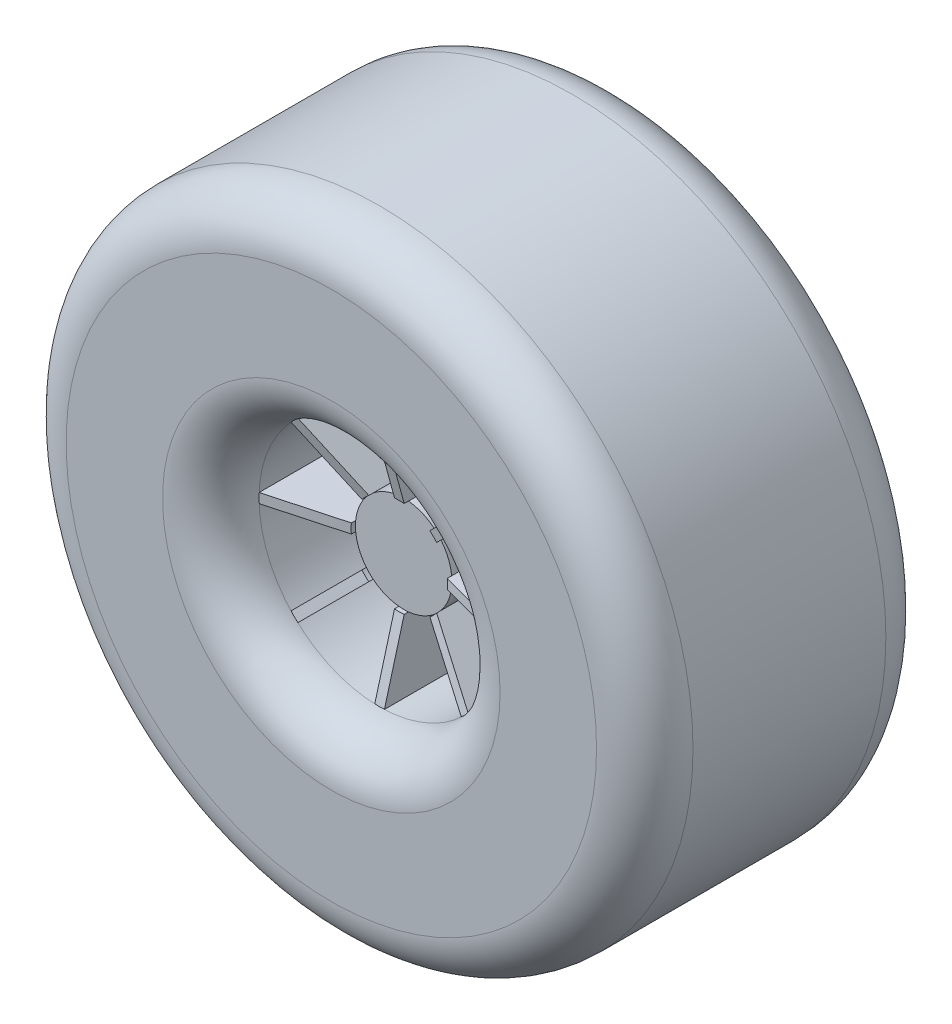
ISO-10303-21;
HEADER;
FILE_DESCRIPTION(('STEP AP214'),'2;1');
FILE_NAME('part.step','',(''),(''),'','','');
FILE_SCHEMA(('AUTOMOTIVE_DESIGN { 1 0 10303 214 1 1 1 1 }'));
ENDSEC;
DATA;
#1=APPLICATION_CONTEXT('core data for automotive mechanical design processes');
#2=APPLICATION_PROTOCOL_DEFINITION('international standard','automotive_design',2000,#1);
#3=PRODUCT_CONTEXT('',#1,'mechanical');
#4=PRODUCT('Part','Part','',(#3));
#5=PRODUCT_RELATED_PRODUCT_CATEGORY('part','',(#4));
#6=PRODUCT_DEFINITION_FORMATION('','',#4);
#7=PRODUCT_DEFINITION_CONTEXT('part definition',#1,'design');
#8=PRODUCT_DEFINITION('design','',#6,#7);
#9=PRODUCT_DEFINITION_SHAPE('','',#8);
#10=(LENGTH_UNIT() NAMED_UNIT(*) SI_UNIT(.MILLI.,.METRE.));
#11=(NAMED_UNIT(*) PLANE_ANGLE_UNIT() SI_UNIT($,.RADIAN.));
#12=(NAMED_UNIT(*) SI_UNIT($,.STERADIAN.) SOLID_ANGLE_UNIT());
#13=UNCERTAINTY_MEASURE_WITH_UNIT(LENGTH_MEASURE(1.E-05),#10,'distance_accuracy_value','');
#14=(GEOMETRIC_REPRESENTATION_CONTEXT(3) GLOBAL_UNCERTAINTY_ASSIGNED_CONTEXT((#13)) GLOBAL_UNIT_ASSIGNED_CONTEXT((#10,
#11,#12)) REPRESENTATION_CONTEXT('',''));
#15=CARTESIAN_POINT('',(0.,0.,0.));
#16=DIRECTION('',(0.,0.,1.));
#17=DIRECTION('',(1.,0.,0.));
#18=AXIS2_PLACEMENT_3D('',#15,#16,#17);
#19=CARTESIAN_POINT('',(0.,1.,0.));
#20=DIRECTION('',(0.,1.,0.));
#21=DIRECTION('',(0.,0.,1.));
#22=AXIS2_PLACEMENT_3D('',#19,#20,#21);
#23=PLANE('',#22);
#24=DIRECTION('',(0.,0.,-1.));
#25=VECTOR('',#24,1.);
#26=CARTESIAN_POINT('',(-9.9498743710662,1.,15.));
#27=LINE('',#26,#25);
#28=CARTESIAN_POINT('',(-9.9498743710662,1.,15.));
#29=VERTEX_POINT('',#28);
#30=CARTESIAN_POINT('',(-9.9498743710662,1.,-15.));
#31=VERTEX_POINT('',#30);
#32=EDGE_CURVE('E813',#29,#31,#27,.T.);
#33=ORIENTED_EDGE('',*,*,#32,.T.);
#34=DIRECTION('',(0.,0.,1.));
#35=VECTOR('',#34,1.);
#36=CARTESIAN_POINT('',(-9.9498743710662,1.,-17.));
#37=LINE('',#36,#35);
#38=CARTESIAN_POINT('',(-9.9498743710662,1.,-15.895417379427));
#39=VERTEX_POINT('',#38);
#40=EDGE_CURVE('E536',#31,#39,#37,.F.);
#41=ORIENTED_EDGE('',*,*,#40,.T.);
#42=DIRECTION('',(-0.96476377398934,0.,-0.263117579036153));
#43=VECTOR('',#42,1.);
#44=CARTESIAN_POINT('',(-6.66667963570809,1.,-15.));
#45=LINE('',#44,#43);
#46=CARTESIAN_POINT('',(-24.9799919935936,1.,-19.99454326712));
#47=VERTEX_POINT('',#46);
#48=EDGE_CURVE('E827',#39,#47,#45,.T.);
#49=ORIENTED_EDGE('',*,*,#48,.T.);
#50=DIRECTION('',(0.,0.,1.));
#51=VECTOR('',#50,1.);
#52=CARTESIAN_POINT('',(-24.9799919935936,1.,-30.));
#53=LINE('',#52,#51);
#54=CARTESIAN_POINT('',(-24.9799919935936,1.,19.99454326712));
#55=VERTEX_POINT('',#54);
#56=EDGE_CURVE('E872',#55,#47,#53,.F.);
#57=ORIENTED_EDGE('',*,*,#56,.F.);
#58=DIRECTION('',(0.96476377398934,0.,-0.263117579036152));
#59=VECTOR('',#58,1.);
#60=CARTESIAN_POINT('',(-22.3772349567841,1.,19.2846999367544));
#61=LINE('',#60,#59);
#62=CARTESIAN_POINT('',(-9.94987437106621,1.,15.895417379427));
#63=VERTEX_POINT('',#62);
#64=EDGE_CURVE('E824',#55,#63,#61,.T.);
#65=ORIENTED_EDGE('',*,*,#64,.T.);
#66=DIRECTION('',(0.,0.,-1.));
#67=VECTOR('',#66,1.);
#68=CARTESIAN_POINT('',(-9.9498743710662,1.,17.));
#69=LINE('',#68,#67);
#70=EDGE_CURVE('E600',#63,#29,#69,.T.);
#71=ORIENTED_EDGE('',*,*,#70,.T.);
#72=EDGE_LOOP('',(#33,#41,#49,#57,#65,#71));
#73=FACE_BOUND('',#72,.T.);
#74=ADVANCED_FACE('F36',(#73),#23,.T.);
#75=CARTESIAN_POINT('',(0.,-1.,0.));
#76=DIRECTION('',(0.,1.,0.));
#77=DIRECTION('',(0.,0.,1.));
#78=AXIS2_PLACEMENT_3D('',#75,#76,#77);
#79=PLANE('',#78);
#80=DIRECTION('',(0.,0.,1.));
#81=VECTOR('',#80,1.);
#82=CARTESIAN_POINT('',(-9.9498743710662,-1.,-17.));
#83=LINE('',#82,#81);
#84=CARTESIAN_POINT('',(-9.9498743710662,-1.,-15.));
#85=VERTEX_POINT('',#84);
#86=CARTESIAN_POINT('',(-9.9498743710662,-1.,-15.895417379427));
#87=VERTEX_POINT('',#86);
#88=EDGE_CURVE('E534',#85,#87,#83,.F.);
#89=ORIENTED_EDGE('',*,*,#88,.F.);
#90=DIRECTION('',(0.,0.,-1.));
#91=VECTOR('',#90,1.);
#92=CARTESIAN_POINT('',(-9.9498743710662,-1.,15.));
#93=LINE('',#92,#91);
#94=CARTESIAN_POINT('',(-9.9498743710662,-1.,15.));
#95=VERTEX_POINT('',#94);
#96=EDGE_CURVE('E875',#95,#85,#93,.T.);
#97=ORIENTED_EDGE('',*,*,#96,.F.);
#98=DIRECTION('',(0.,0.,-1.));
#99=VECTOR('',#98,1.);
#100=CARTESIAN_POINT('',(-9.9498743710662,-1.,17.));
#101=LINE('',#100,#99);
#102=CARTESIAN_POINT('',(-9.9498743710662,-1.,15.895417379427));
#103=VERTEX_POINT('',#102);
#104=EDGE_CURVE('E598',#103,#95,#101,.T.);
#105=ORIENTED_EDGE('',*,*,#104,.F.);
#106=DIRECTION('',(0.96476377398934,0.,-0.263117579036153));
#107=VECTOR('',#106,1.);
#108=CARTESIAN_POINT('',(-10.2560816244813,-1.,15.9789285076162));
#109=LINE('',#108,#107);
#110=CARTESIAN_POINT('',(-24.9799919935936,-1.,19.99454326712));
#111=VERTEX_POINT('',#110);
#112=EDGE_CURVE('E823',#111,#103,#109,.T.);
#113=ORIENTED_EDGE('',*,*,#112,.F.);
#114=DIRECTION('',(0.,0.,1.));
#115=VECTOR('',#114,1.);
#116=CARTESIAN_POINT('',(-24.9799919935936,-1.,-30.));
#117=LINE('',#116,#115);
#118=CARTESIAN_POINT('',(-24.9799919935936,-1.,-19.99454326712));
#119=VERTEX_POINT('',#118);
#120=EDGE_CURVE('E869',#111,#119,#117,.F.);
#121=ORIENTED_EDGE('',*,*,#120,.T.);
#122=DIRECTION('',(-0.964763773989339,0.,-0.263117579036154));
#123=VECTOR('',#122,1.);
#124=CARTESIAN_POINT('',(-22.3772349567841,-1.,-19.2846999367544));
#125=LINE('',#124,#123);
#126=EDGE_CURVE('E828',#87,#119,#125,.T.);
#127=ORIENTED_EDGE('',*,*,#126,.F.);
#128=EDGE_LOOP('',(#89,#97,#105,#113,#121,#127));
#129=FACE_BOUND('',#128,.T.);
#130=ADVANCED_FACE('F1040',(#129),#79,.F.);
#131=CARTESIAN_POINT('',(-0.707106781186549,0.707106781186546,0.));
#132=DIRECTION('',(-0.707106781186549,0.707106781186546,0.));
#133=DIRECTION('',(0.,0.,1.));
#134=AXIS2_PLACEMENT_3D('',#131,#132,#133);
#135=PLANE('',#134);
#136=DIRECTION('',(0.,0.,-1.));
#137=VECTOR('',#136,1.);
#138=CARTESIAN_POINT('',(-7.74273042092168,-6.32851685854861,15.));
#139=LINE('',#138,#137);
#140=CARTESIAN_POINT('',(-7.74273042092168,-6.32851685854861,-15.));
#141=VERTEX_POINT('',#140);
#142=CARTESIAN_POINT('',(-7.74273042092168,-6.32851685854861,15.));
#143=VERTEX_POINT('',#142);
#144=EDGE_CURVE('E796',#141,#143,#139,.F.);
#145=ORIENTED_EDGE('',*,*,#144,.F.);
#146=DIRECTION('',(0.,0.,1.));
#147=VECTOR('',#146,1.);
#148=CARTESIAN_POINT('',(-7.74273042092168,-6.32851685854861,-17.));
#149=LINE('',#148,#147);
#150=CARTESIAN_POINT('',(-7.74273042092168,-6.32851685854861,-15.895417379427));
#151=VERTEX_POINT('',#150);
#152=EDGE_CURVE('E529',#141,#151,#149,.F.);
#153=ORIENTED_EDGE('',*,*,#152,.T.);
#154=DIRECTION('',(-0.682191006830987,-0.682191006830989,-0.263117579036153));
#155=VECTOR('',#154,1.);
#156=CARTESIAN_POINT('',(-5.421161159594,-4.00694759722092,-15.));
#157=LINE('',#156,#155);
#158=CARTESIAN_POINT('',(-18.3706285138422,-16.9564149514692,-19.99454326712));
#159=VERTEX_POINT('',#158);
#160=EDGE_CURVE('E783',#151,#159,#157,.T.);
#161=ORIENTED_EDGE('',*,*,#160,.T.);
#162=DIRECTION('',(0.,0.,1.));
#163=VECTOR('',#162,1.);
#164=CARTESIAN_POINT('',(-18.3706285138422,-16.9564149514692,-30.));
#165=LINE('',#164,#163);
#166=CARTESIAN_POINT('',(-18.3706285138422,-16.9564149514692,19.99454326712));
#167=VERTEX_POINT('',#166);
#168=EDGE_CURVE('E799',#167,#159,#165,.F.);
#169=ORIENTED_EDGE('',*,*,#168,.F.);
#170=DIRECTION('',(0.682191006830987,0.682191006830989,-0.263117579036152));
#171=VECTOR('',#170,1.);
#172=CARTESIAN_POINT('',(-16.5302013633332,-15.1159878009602,19.2846999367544));
#173=LINE('',#172,#171);
#174=CARTESIAN_POINT('',(-7.74273042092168,-6.32851685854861,15.895417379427));
#175=VERTEX_POINT('',#174);
#176=EDGE_CURVE('E780',#167,#175,#173,.T.);
#177=ORIENTED_EDGE('',*,*,#176,.T.);
#178=DIRECTION('',(0.,0.,-1.));
#179=VECTOR('',#178,1.);
#180=CARTESIAN_POINT('',(-7.74273042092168,-6.32851685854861,17.));
#181=LINE('',#180,#179);
#182=EDGE_CURVE('E593',#175,#143,#181,.T.);
#183=ORIENTED_EDGE('',*,*,#182,.T.);
#184=EDGE_LOOP('',(#145,#153,#161,#169,#177,#183));
#185=FACE_BOUND('',#184,.T.);
#186=ADVANCED_FACE('F1005',(#185),#135,.T.);
#187=CARTESIAN_POINT('',(0.707106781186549,-0.707106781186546,0.));
#188=DIRECTION('',(-0.707106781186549,0.707106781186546,0.));
#189=DIRECTION('',(0.,0.,1.));
#190=AXIS2_PLACEMENT_3D('',#187,#188,#189);
#191=PLANE('',#190);
#192=DIRECTION('',(0.,0.,1.));
#193=VECTOR('',#192,1.);
#194=CARTESIAN_POINT('',(-6.32851685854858,-7.7427304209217,-17.));
#195=LINE('',#194,#193);
#196=CARTESIAN_POINT('',(-6.32851685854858,-7.7427304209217,-15.));
#197=VERTEX_POINT('',#196);
#198=CARTESIAN_POINT('',(-6.32851685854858,-7.7427304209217,-15.895417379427));
#199=VERTEX_POINT('',#198);
#200=EDGE_CURVE('E527',#197,#199,#195,.F.);
#201=ORIENTED_EDGE('',*,*,#200,.F.);
#202=DIRECTION('',(0.,0.,-1.));
#203=VECTOR('',#202,1.);
#204=CARTESIAN_POINT('',(-6.32851685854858,-7.7427304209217,15.));
#205=LINE('',#204,#203);
#206=CARTESIAN_POINT('',(-6.32851685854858,-7.7427304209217,15.));
#207=VERTEX_POINT('',#206);
#208=EDGE_CURVE('E786',#197,#207,#205,.F.);
#209=ORIENTED_EDGE('',*,*,#208,.T.);
#210=DIRECTION('',(0.,0.,-1.));
#211=VECTOR('',#210,1.);
#212=CARTESIAN_POINT('',(-6.32851685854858,-7.7427304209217,17.));
#213=LINE('',#212,#211);
#214=CARTESIAN_POINT('',(-6.32851685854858,-7.7427304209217,15.895417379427));
#215=VERTEX_POINT('',#214);
#216=EDGE_CURVE('E588',#215,#207,#213,.T.);
#217=ORIENTED_EDGE('',*,*,#216,.F.);
#218=DIRECTION('',(0.682191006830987,0.682191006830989,-0.263117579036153));
#219=VECTOR('',#218,1.);
#220=CARTESIAN_POINT('',(-6.54503808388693,-7.95925164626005,15.9789285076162));
#221=LINE('',#220,#219);
#222=CARTESIAN_POINT('',(-16.9564149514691,-18.3706285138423,19.99454326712));
#223=VERTEX_POINT('',#222);
#224=EDGE_CURVE('E787',#223,#215,#221,.T.);
#225=ORIENTED_EDGE('',*,*,#224,.F.);
#226=DIRECTION('',(0.,0.,1.));
#227=VECTOR('',#226,1.);
#228=CARTESIAN_POINT('',(-16.9564149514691,-18.3706285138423,-30.));
#229=LINE('',#228,#227);
#230=CARTESIAN_POINT('',(-16.9564149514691,-18.3706285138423,-19.99454326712));
#231=VERTEX_POINT('',#230);
#232=EDGE_CURVE('E793',#223,#231,#229,.F.);
#233=ORIENTED_EDGE('',*,*,#232,.T.);
#234=DIRECTION('',(-0.682191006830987,-0.682191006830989,-0.263117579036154));
#235=VECTOR('',#234,1.);
#236=CARTESIAN_POINT('',(-15.1159878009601,-16.5302013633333,-19.2846999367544));
#237=LINE('',#236,#235);
#238=EDGE_CURVE('E784',#199,#231,#237,.T.);
#239=ORIENTED_EDGE('',*,*,#238,.F.);
#240=EDGE_LOOP('',(#201,#209,#217,#225,#233,#239));
#241=FACE_BOUND('',#240,.T.);
#242=ADVANCED_FACE('F922',(#241),#191,.F.);
#243=CARTESIAN_POINT('',(-1.,0.,0.));
#244=DIRECTION('',(-1.,0.,0.));
#245=DIRECTION('',(0.,0.,1.));
#246=AXIS2_PLACEMENT_3D('',#243,#244,#245);
#247=PLANE('',#246);
#248=DIRECTION('',(0.,0.,-1.));
#249=VECTOR('',#248,1.);
#250=CARTESIAN_POINT('',(-0.999999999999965,-9.9498743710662,15.));
#251=LINE('',#250,#249);
#252=CARTESIAN_POINT('',(-0.999999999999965,-9.9498743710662,-15.));
#253=VERTEX_POINT('',#252);
#254=CARTESIAN_POINT('',(-0.999999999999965,-9.9498743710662,15.));
#255=VERTEX_POINT('',#254);
#256=EDGE_CURVE('E766',#253,#255,#251,.F.);
#257=ORIENTED_EDGE('',*,*,#256,.F.);
#258=DIRECTION('',(0.,0.,1.));
#259=VECTOR('',#258,1.);
#260=CARTESIAN_POINT('',(-0.999999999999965,-9.9498743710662,-17.));
#261=LINE('',#260,#259);
#262=CARTESIAN_POINT('',(-0.999999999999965,-9.9498743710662,-15.895417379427));
#263=VERTEX_POINT('',#262);
#264=EDGE_CURVE('E522',#253,#263,#261,.F.);
#265=ORIENTED_EDGE('',*,*,#264,.T.);
#266=DIRECTION('',(0.,-0.96476377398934,-0.263117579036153));
#267=VECTOR('',#266,1.);
#268=CARTESIAN_POINT('',(-0.999999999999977,-6.6666796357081,-15.));
#269=LINE('',#268,#267);
#270=CARTESIAN_POINT('',(-0.999999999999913,-24.9799919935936,-19.99454326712));
#271=VERTEX_POINT('',#270);
#272=EDGE_CURVE('E753',#263,#271,#269,.T.);
#273=ORIENTED_EDGE('',*,*,#272,.T.);
#274=DIRECTION('',(0.,0.,1.));
#275=VECTOR('',#274,1.);
#276=CARTESIAN_POINT('',(-0.999999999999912,-24.9799919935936,-30.));
#277=LINE('',#276,#275);
#278=CARTESIAN_POINT('',(-0.999999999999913,-24.9799919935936,19.99454326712));
#279=VERTEX_POINT('',#278);
#280=EDGE_CURVE('E769',#279,#271,#277,.F.);
#281=ORIENTED_EDGE('',*,*,#280,.F.);
#282=DIRECTION('',(0.,0.96476377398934,-0.263117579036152));
#283=VECTOR('',#282,1.);
#284=CARTESIAN_POINT('',(-0.999999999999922,-22.3772349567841,19.2846999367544));
#285=LINE('',#284,#283);
#286=CARTESIAN_POINT('',(-0.999999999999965,-9.94987437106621,15.895417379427));
#287=VERTEX_POINT('',#286);
#288=EDGE_CURVE('E750',#279,#287,#285,.T.);
#289=ORIENTED_EDGE('',*,*,#288,.T.);
#290=DIRECTION('',(0.,0.,-1.));
#291=VECTOR('',#290,1.);
#292=CARTESIAN_POINT('',(-0.999999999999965,-9.9498743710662,17.));
#293=LINE('',#292,#291);
#294=EDGE_CURVE('E585',#287,#255,#293,.T.);
#295=ORIENTED_EDGE('',*,*,#294,.T.);
#296=EDGE_LOOP('',(#257,#265,#273,#281,#289,#295));
#297=FACE_BOUND('',#296,.T.);
#298=ADVANCED_FACE('F1275',(#297),#247,.T.);
#299=CARTESIAN_POINT('',(1.,0.,0.));
#300=DIRECTION('',(-1.,0.,0.));
#301=DIRECTION('',(0.,0.,1.));
#302=AXIS2_PLACEMENT_3D('',#299,#300,#301);
#303=PLANE('',#302);
#304=DIRECTION('',(0.,0.,1.));
#305=VECTOR('',#304,1.);
#306=CARTESIAN_POINT('',(1.00000000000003,-9.94987437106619,-17.));
#307=LINE('',#306,#305);
#308=CARTESIAN_POINT('',(1.00000000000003,-9.9498743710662,-15.));
#309=VERTEX_POINT('',#308);
#310=CARTESIAN_POINT('',(1.00000000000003,-9.9498743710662,-15.895417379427));
#311=VERTEX_POINT('',#310);
#312=EDGE_CURVE('E520',#309,#311,#307,.F.);
#313=ORIENTED_EDGE('',*,*,#312,.F.);
#314=DIRECTION('',(0.,0.,-1.));
#315=VECTOR('',#314,1.);
#316=CARTESIAN_POINT('',(1.00000000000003,-9.94987437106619,15.));
#317=LINE('',#316,#315);
#318=CARTESIAN_POINT('',(1.00000000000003,-9.9498743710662,15.));
#319=VERTEX_POINT('',#318);
#320=EDGE_CURVE('E756',#309,#319,#317,.F.);
#321=ORIENTED_EDGE('',*,*,#320,.T.);
#322=DIRECTION('',(0.,0.,-1.));
#323=VECTOR('',#322,1.);
#324=CARTESIAN_POINT('',(1.00000000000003,-9.94987437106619,17.));
#325=LINE('',#324,#323);
#326=CARTESIAN_POINT('',(1.00000000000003,-9.94987437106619,15.895417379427));
#327=VERTEX_POINT('',#326);
#328=EDGE_CURVE('E580',#327,#319,#325,.T.);
#329=ORIENTED_EDGE('',*,*,#328,.F.);
#330=DIRECTION('',(0.,0.96476377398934,-0.263117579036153));
#331=VECTOR('',#330,1.);
#332=CARTESIAN_POINT('',(1.00000000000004,-10.2560816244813,15.9789285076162));
#333=LINE('',#332,#331);
#334=CARTESIAN_POINT('',(1.00000000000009,-24.9799919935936,19.99454326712));
#335=VERTEX_POINT('',#334);
#336=EDGE_CURVE('E757',#335,#327,#333,.T.);
#337=ORIENTED_EDGE('',*,*,#336,.F.);
#338=DIRECTION('',(0.,0.,1.));
#339=VECTOR('',#338,1.);
#340=CARTESIAN_POINT('',(1.00000000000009,-24.9799919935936,-30.));
#341=LINE('',#340,#339);
#342=CARTESIAN_POINT('',(1.00000000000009,-24.9799919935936,-19.99454326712));
#343=VERTEX_POINT('',#342);
#344=EDGE_CURVE('E763',#335,#343,#341,.F.);
#345=ORIENTED_EDGE('',*,*,#344,.T.);
#346=DIRECTION('',(0.,-0.964763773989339,-0.263117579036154));
#347=VECTOR('',#346,1.);
#348=CARTESIAN_POINT('',(1.00000000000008,-22.3772349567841,-19.2846999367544));
#349=LINE('',#348,#347);
#350=EDGE_CURVE('E754',#311,#343,#349,.T.);
#351=ORIENTED_EDGE('',*,*,#350,.F.);
#352=EDGE_LOOP('',(#313,#321,#329,#337,#345,#351));
#353=FACE_BOUND('',#352,.T.);
#354=ADVANCED_FACE('F1269',(#353),#303,.F.);
#355=CARTESIAN_POINT('',(-0.707106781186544,-0.707106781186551,0.));
#356=DIRECTION('',(-0.707106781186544,-0.707106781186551,0.));
#357=DIRECTION('',(0.,0.,1.));
#358=AXIS2_PLACEMENT_3D('',#355,#356,#357);
#359=PLANE('',#358);
#360=DIRECTION('',(0.,0.,-1.));
#361=VECTOR('',#360,1.);
#362=CARTESIAN_POINT('',(6.32851685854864,-7.74273042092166,15.));
#363=LINE('',#362,#361);
#364=CARTESIAN_POINT('',(6.32851685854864,-7.74273042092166,-15.));
#365=VERTEX_POINT('',#364);
#366=CARTESIAN_POINT('',(6.32851685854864,-7.74273042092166,15.));
#367=VERTEX_POINT('',#366);
#368=EDGE_CURVE('E736',#365,#367,#363,.F.);
#369=ORIENTED_EDGE('',*,*,#368,.F.);
#370=DIRECTION('',(0.,0.,1.));
#371=VECTOR('',#370,1.);
#372=CARTESIAN_POINT('',(6.32851685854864,-7.74273042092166,-17.));
#373=LINE('',#372,#371);
#374=CARTESIAN_POINT('',(6.32851685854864,-7.74273042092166,-15.895417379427));
#375=VERTEX_POINT('',#374);
#376=EDGE_CURVE('E515',#365,#375,#373,.F.);
#377=ORIENTED_EDGE('',*,*,#376,.T.);
#378=DIRECTION('',(0.682191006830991,-0.682191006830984,-0.263117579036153));
#379=VECTOR('',#378,1.);
#380=CARTESIAN_POINT('',(4.00694759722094,-5.42116115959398,-15.));
#381=LINE('',#380,#379);
#382=CARTESIAN_POINT('',(16.9564149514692,-18.3706285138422,-19.99454326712));
#383=VERTEX_POINT('',#382);
#384=EDGE_CURVE('E723',#375,#383,#381,.T.);
#385=ORIENTED_EDGE('',*,*,#384,.T.);
#386=DIRECTION('',(0.,0.,1.));
#387=VECTOR('',#386,1.);
#388=CARTESIAN_POINT('',(16.9564149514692,-18.3706285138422,-30.));
#389=LINE('',#388,#387);
#390=CARTESIAN_POINT('',(16.9564149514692,-18.3706285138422,19.99454326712));
#391=VERTEX_POINT('',#390);
#392=EDGE_CURVE('E739',#391,#383,#389,.F.);
#393=ORIENTED_EDGE('',*,*,#392,.F.);
#394=DIRECTION('',(-0.682191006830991,0.682191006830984,-0.263117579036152));
#395=VECTOR('',#394,1.);
#396=CARTESIAN_POINT('',(15.1159878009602,-16.5302013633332,19.2846999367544));
#397=LINE('',#396,#395);
#398=CARTESIAN_POINT('',(6.32851685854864,-7.74273042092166,15.895417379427));
#399=VERTEX_POINT('',#398);
#400=EDGE_CURVE('E720',#391,#399,#397,.T.);
#401=ORIENTED_EDGE('',*,*,#400,.T.);
#402=DIRECTION('',(0.,0.,-1.));
#403=VECTOR('',#402,1.);
#404=CARTESIAN_POINT('',(6.32851685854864,-7.74273042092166,17.));
#405=LINE('',#404,#403);
#406=EDGE_CURVE('E577',#399,#367,#405,.T.);
#407=ORIENTED_EDGE('',*,*,#406,.T.);
#408=EDGE_LOOP('',(#369,#377,#385,#393,#401,#407));
#409=FACE_BOUND('',#408,.T.);
#410=ADVANCED_FACE('F1178',(#409),#359,.T.);
#411=CARTESIAN_POINT('',(0.707106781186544,0.707106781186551,0.));
#412=DIRECTION('',(-0.707106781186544,-0.707106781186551,0.));
#413=DIRECTION('',(0.,0.,1.));
#414=AXIS2_PLACEMENT_3D('',#411,#412,#413);
#415=PLANE('',#414);
#416=DIRECTION('',(0.,0.,1.));
#417=VECTOR('',#416,1.);
#418=CARTESIAN_POINT('',(7.74273042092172,-6.32851685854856,-17.));
#419=LINE('',#418,#417);
#420=CARTESIAN_POINT('',(7.74273042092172,-6.32851685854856,-15.));
#421=VERTEX_POINT('',#420);
#422=CARTESIAN_POINT('',(7.74273042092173,-6.32851685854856,-15.895417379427));
#423=VERTEX_POINT('',#422);
#424=EDGE_CURVE('E513',#421,#423,#419,.F.);
#425=ORIENTED_EDGE('',*,*,#424,.F.);
#426=DIRECTION('',(0.,0.,-1.));
#427=VECTOR('',#426,1.);
#428=CARTESIAN_POINT('',(7.74273042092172,-6.32851685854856,15.));
#429=LINE('',#428,#427);
#430=CARTESIAN_POINT('',(7.74273042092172,-6.32851685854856,15.));
#431=VERTEX_POINT('',#430);
#432=EDGE_CURVE('E726',#421,#431,#429,.F.);
#433=ORIENTED_EDGE('',*,*,#432,.T.);
#434=DIRECTION('',(0.,0.,-1.));
#435=VECTOR('',#434,1.);
#436=CARTESIAN_POINT('',(7.74273042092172,-6.32851685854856,17.));
#437=LINE('',#436,#435);
#438=CARTESIAN_POINT('',(7.74273042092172,-6.32851685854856,15.895417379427));
#439=VERTEX_POINT('',#438);
#440=EDGE_CURVE('E572',#439,#431,#437,.T.);
#441=ORIENTED_EDGE('',*,*,#440,.F.);
#442=DIRECTION('',(-0.682191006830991,0.682191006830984,-0.263117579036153));
#443=VECTOR('',#442,1.);
#444=CARTESIAN_POINT('',(7.95925164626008,-6.5450380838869,15.9789285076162));
#445=LINE('',#444,#443);
#446=CARTESIAN_POINT('',(18.3706285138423,-16.956414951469,19.99454326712));
#447=VERTEX_POINT('',#446);
#448=EDGE_CURVE('E727',#447,#439,#445,.T.);
#449=ORIENTED_EDGE('',*,*,#448,.F.);
#450=DIRECTION('',(0.,0.,1.));
#451=VECTOR('',#450,1.);
#452=CARTESIAN_POINT('',(18.3706285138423,-16.956414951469,-30.));
#453=LINE('',#452,#451);
#454=CARTESIAN_POINT('',(18.3706285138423,-16.956414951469,-19.99454326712));
#455=VERTEX_POINT('',#454);
#456=EDGE_CURVE('E733',#447,#455,#453,.F.);
#457=ORIENTED_EDGE('',*,*,#456,.T.);
#458=DIRECTION('',(0.682191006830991,-0.682191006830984,-0.263117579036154));
#459=VECTOR('',#458,1.);
#460=CARTESIAN_POINT('',(16.5302013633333,-15.1159878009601,-19.2846999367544));
#461=LINE('',#460,#459);
#462=EDGE_CURVE('E724',#423,#455,#461,.T.);
#463=ORIENTED_EDGE('',*,*,#462,.F.);
#464=EDGE_LOOP('',(#425,#433,#441,#449,#457,#463));
#465=FACE_BOUND('',#464,.T.);
#466=ADVANCED_FACE('F1168',(#465),#415,.F.);
#467=CARTESIAN_POINT('',(0.,-1.,0.));
#468=DIRECTION('',(0.,-1.,0.));
#469=DIRECTION('',(0.,0.,1.));
#470=AXIS2_PLACEMENT_3D('',#467,#468,#469);
#471=PLANE('',#470);
#472=DIRECTION('',(0.,0.,-1.));
#473=VECTOR('',#472,1.);
#474=CARTESIAN_POINT('',(9.9498743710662,-1.,15.));
#475=LINE('',#474,#473);
#476=CARTESIAN_POINT('',(9.9498743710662,-1.,-15.));
#477=VERTEX_POINT('',#476);
#478=CARTESIAN_POINT('',(9.9498743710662,-1.,15.));
#479=VERTEX_POINT('',#478);
#480=EDGE_CURVE('E706',#477,#479,#475,.F.);
#481=ORIENTED_EDGE('',*,*,#480,.F.);
#482=DIRECTION('',(0.,0.,1.));
#483=VECTOR('',#482,1.);
#484=CARTESIAN_POINT('',(9.9498743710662,-1.,-17.));
#485=LINE('',#484,#483);
#486=CARTESIAN_POINT('',(9.9498743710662,-1.,-15.895417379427));
#487=VERTEX_POINT('',#486);
#488=EDGE_CURVE('E508',#477,#487,#485,.F.);
#489=ORIENTED_EDGE('',*,*,#488,.T.);
#490=DIRECTION('',(0.96476377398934,0.,-0.263117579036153));
#491=VECTOR('',#490,1.);
#492=CARTESIAN_POINT('',(6.66667963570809,-1.,-15.));
#493=LINE('',#492,#491);
#494=CARTESIAN_POINT('',(24.9799919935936,-1.,-19.99454326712));
#495=VERTEX_POINT('',#494);
#496=EDGE_CURVE('E693',#487,#495,#493,.T.);
#497=ORIENTED_EDGE('',*,*,#496,.T.);
#498=DIRECTION('',(0.,0.,1.));
#499=VECTOR('',#498,1.);
#500=CARTESIAN_POINT('',(24.9799919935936,-1.,-30.));
#501=LINE('',#500,#499);
#502=CARTESIAN_POINT('',(24.9799919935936,-1.,19.99454326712));
#503=VERTEX_POINT('',#502);
#504=EDGE_CURVE('E709',#503,#495,#501,.F.);
#505=ORIENTED_EDGE('',*,*,#504,.F.);
#506=DIRECTION('',(-0.96476377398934,0.,-0.263117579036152));
#507=VECTOR('',#506,1.);
#508=CARTESIAN_POINT('',(22.3772349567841,-1.,19.2846999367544));
#509=LINE('',#508,#507);
#510=CARTESIAN_POINT('',(9.94987437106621,-1.,15.895417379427));
#511=VERTEX_POINT('',#510);
#512=EDGE_CURVE('E690',#503,#511,#509,.T.);
#513=ORIENTED_EDGE('',*,*,#512,.T.);
#514=DIRECTION('',(0.,0.,-1.));
#515=VECTOR('',#514,1.);
#516=CARTESIAN_POINT('',(9.9498743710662,-1.,17.));
#517=LINE('',#516,#515);
#518=EDGE_CURVE('E569',#511,#479,#517,.T.);
#519=ORIENTED_EDGE('',*,*,#518,.T.);
#520=EDGE_LOOP('',(#481,#489,#497,#505,#513,#519));
#521=FACE_BOUND('',#520,.T.);
#522=ADVANCED_FACE('F1237',(#521),#471,.T.);
#523=CARTESIAN_POINT('',(0.,1.,0.));
#524=DIRECTION('',(0.,-1.,0.));
#525=DIRECTION('',(0.,0.,1.));
#526=AXIS2_PLACEMENT_3D('',#523,#524,#525);
#527=PLANE('',#526);
#528=DIRECTION('',(0.,0.,1.));
#529=VECTOR('',#528,1.);
#530=CARTESIAN_POINT('',(9.9498743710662,1.,-17.));
#531=LINE('',#530,#529);
#532=CARTESIAN_POINT('',(9.9498743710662,1.,-15.));
#533=VERTEX_POINT('',#532);
#534=CARTESIAN_POINT('',(9.9498743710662,1.,-15.895417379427));
#535=VERTEX_POINT('',#534);
#536=EDGE_CURVE('E506',#533,#535,#531,.F.);
#537=ORIENTED_EDGE('',*,*,#536,.F.);
#538=DIRECTION('',(0.,0.,-1.));
#539=VECTOR('',#538,1.);
#540=CARTESIAN_POINT('',(9.9498743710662,1.,15.));
#541=LINE('',#540,#539);
#542=CARTESIAN_POINT('',(9.9498743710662,1.,15.));
#543=VERTEX_POINT('',#542);
#544=EDGE_CURVE('E696',#533,#543,#541,.F.);
#545=ORIENTED_EDGE('',*,*,#544,.T.);
#546=DIRECTION('',(0.,0.,-1.));
#547=VECTOR('',#546,1.);
#548=CARTESIAN_POINT('',(9.9498743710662,1.,17.));
#549=LINE('',#548,#547);
#550=CARTESIAN_POINT('',(9.9498743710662,1.,15.895417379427));
#551=VERTEX_POINT('',#550);
#552=EDGE_CURVE('E564',#551,#543,#549,.T.);
#553=ORIENTED_EDGE('',*,*,#552,.F.);
#554=DIRECTION('',(-0.96476377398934,0.,-0.263117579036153));
#555=VECTOR('',#554,1.);
#556=CARTESIAN_POINT('',(10.2560816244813,1.,15.9789285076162));
#557=LINE('',#556,#555);
#558=CARTESIAN_POINT('',(24.9799919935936,1.,19.99454326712));
#559=VERTEX_POINT('',#558);
#560=EDGE_CURVE('E697',#559,#551,#557,.T.);
#561=ORIENTED_EDGE('',*,*,#560,.F.);
#562=DIRECTION('',(0.,0.,1.));
#563=VECTOR('',#562,1.);
#564=CARTESIAN_POINT('',(24.9799919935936,1.,-30.));
#565=LINE('',#564,#563);
#566=CARTESIAN_POINT('',(24.9799919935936,1.,-19.99454326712));
#567=VERTEX_POINT('',#566);
#568=EDGE_CURVE('E703',#559,#567,#565,.F.);
#569=ORIENTED_EDGE('',*,*,#568,.T.);
#570=DIRECTION('',(0.964763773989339,0.,-0.263117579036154));
#571=VECTOR('',#570,1.);
#572=CARTESIAN_POINT('',(22.3772349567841,1.,-19.2846999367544));
#573=LINE('',#572,#571);
#574=EDGE_CURVE('E694',#535,#567,#573,.T.);
#575=ORIENTED_EDGE('',*,*,#574,.F.);
#576=EDGE_LOOP('',(#537,#545,#553,#561,#569,#575));
#577=FACE_BOUND('',#576,.T.);
#578=ADVANCED_FACE('F1198',(#577),#527,.F.);
#579=CARTESIAN_POINT('',(0.707106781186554,-0.707106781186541,0.));
#580=DIRECTION('',(0.707106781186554,-0.707106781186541,0.));
#581=DIRECTION('',(0.,0.,1.));
#582=AXIS2_PLACEMENT_3D('',#579,#580,#581);
#583=PLANE('',#582);
#584=DIRECTION('',(0.,0.,-1.));
#585=VECTOR('',#584,1.);
#586=CARTESIAN_POINT('',(7.74273042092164,6.32851685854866,15.));
#587=LINE('',#586,#585);
#588=CARTESIAN_POINT('',(7.74273042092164,6.32851685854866,-15.));
#589=VERTEX_POINT('',#588);
#590=CARTESIAN_POINT('',(7.74273042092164,6.32851685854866,15.));
#591=VERTEX_POINT('',#590);
#592=EDGE_CURVE('E676',#589,#591,#587,.F.);
#593=ORIENTED_EDGE('',*,*,#592,.F.);
#594=DIRECTION('',(0.,0.,1.));
#595=VECTOR('',#594,1.);
#596=CARTESIAN_POINT('',(7.74273042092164,6.32851685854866,-17.));
#597=LINE('',#596,#595);
#598=CARTESIAN_POINT('',(7.74273042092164,6.32851685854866,-15.895417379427));
#599=VERTEX_POINT('',#598);
#600=EDGE_CURVE('E501',#589,#599,#597,.F.);
#601=ORIENTED_EDGE('',*,*,#600,.T.);
#602=DIRECTION('',(0.682191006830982,0.682191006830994,-0.263117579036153));
#603=VECTOR('',#602,1.);
#604=CARTESIAN_POINT('',(5.42116115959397,4.00694759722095,-15.));
#605=LINE('',#604,#603);
#606=CARTESIAN_POINT('',(18.3706285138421,16.9564149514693,-19.99454326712));
#607=VERTEX_POINT('',#606);
#608=EDGE_CURVE('E663',#599,#607,#605,.T.);
#609=ORIENTED_EDGE('',*,*,#608,.T.);
#610=DIRECTION('',(0.,0.,1.));
#611=VECTOR('',#610,1.);
#612=CARTESIAN_POINT('',(18.3706285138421,16.9564149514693,-30.));
#613=LINE('',#612,#611);
#614=CARTESIAN_POINT('',(18.3706285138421,16.9564149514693,19.99454326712));
#615=VERTEX_POINT('',#614);
#616=EDGE_CURVE('E679',#615,#607,#613,.F.);
#617=ORIENTED_EDGE('',*,*,#616,.F.);
#618=DIRECTION('',(-0.682191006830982,-0.682191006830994,-0.263117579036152));
#619=VECTOR('',#618,1.);
#620=CARTESIAN_POINT('',(16.5302013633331,15.1159878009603,19.2846999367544));
#621=LINE('',#620,#619);
#622=CARTESIAN_POINT('',(7.74273042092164,6.32851685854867,15.895417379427));
#623=VERTEX_POINT('',#622);
#624=EDGE_CURVE('E660',#615,#623,#621,.T.);
#625=ORIENTED_EDGE('',*,*,#624,.T.);
#626=DIRECTION('',(0.,0.,-1.));
#627=VECTOR('',#626,1.);
#628=CARTESIAN_POINT('',(7.74273042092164,6.32851685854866,17.));
#629=LINE('',#628,#627);
#630=EDGE_CURVE('E561',#623,#591,#629,.T.);
#631=ORIENTED_EDGE('',*,*,#630,.T.);
#632=EDGE_LOOP('',(#593,#601,#609,#617,#625,#631));
#633=FACE_BOUND('',#632,.T.);
#634=ADVANCED_FACE('F1207',(#633),#583,.T.);
#635=CARTESIAN_POINT('',(-0.707106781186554,0.707106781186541,0.));
#636=DIRECTION('',(0.707106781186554,-0.707106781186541,0.));
#637=DIRECTION('',(0.,0.,1.));
#638=AXIS2_PLACEMENT_3D('',#635,#636,#637);
#639=PLANE('',#638);
#640=DIRECTION('',(0.,0.,1.));
#641=VECTOR('',#640,1.);
#642=CARTESIAN_POINT('',(6.32851685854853,7.74273042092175,-17.));
#643=LINE('',#642,#641);
#644=CARTESIAN_POINT('',(6.32851685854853,7.74273042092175,-15.));
#645=VERTEX_POINT('',#644);
#646=CARTESIAN_POINT('',(6.32851685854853,7.74273042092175,-15.895417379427));
#647=VERTEX_POINT('',#646);
#648=EDGE_CURVE('E499',#645,#647,#643,.F.);
#649=ORIENTED_EDGE('',*,*,#648,.F.);
#650=DIRECTION('',(0.,0.,-1.));
#651=VECTOR('',#650,1.);
#652=CARTESIAN_POINT('',(6.32851685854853,7.74273042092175,15.));
#653=LINE('',#652,#651);
#654=CARTESIAN_POINT('',(6.32851685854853,7.74273042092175,15.));
#655=VERTEX_POINT('',#654);
#656=EDGE_CURVE('E666',#645,#655,#653,.F.);
#657=ORIENTED_EDGE('',*,*,#656,.T.);
#658=DIRECTION('',(0.,0.,-1.));
#659=VECTOR('',#658,1.);
#660=CARTESIAN_POINT('',(6.32851685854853,7.74273042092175,17.));
#661=LINE('',#660,#659);
#662=CARTESIAN_POINT('',(6.32851685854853,7.74273042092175,15.895417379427));
#663=VERTEX_POINT('',#662);
#664=EDGE_CURVE('E556',#663,#655,#661,.T.);
#665=ORIENTED_EDGE('',*,*,#664,.F.);
#666=DIRECTION('',(-0.682191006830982,-0.682191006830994,-0.263117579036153));
#667=VECTOR('',#666,1.);
#668=CARTESIAN_POINT('',(6.54503808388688,7.9592516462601,15.9789285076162));
#669=LINE('',#668,#667);
#670=CARTESIAN_POINT('',(16.956414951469,18.3706285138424,19.99454326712));
#671=VERTEX_POINT('',#670);
#672=EDGE_CURVE('E667',#671,#663,#669,.T.);
#673=ORIENTED_EDGE('',*,*,#672,.F.);
#674=DIRECTION('',(0.,0.,1.));
#675=VECTOR('',#674,1.);
#676=CARTESIAN_POINT('',(16.956414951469,18.3706285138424,-30.));
#677=LINE('',#676,#675);
#678=CARTESIAN_POINT('',(16.956414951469,18.3706285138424,-19.99454326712));
#679=VERTEX_POINT('',#678);
#680=EDGE_CURVE('E673',#671,#679,#677,.F.);
#681=ORIENTED_EDGE('',*,*,#680,.T.);
#682=DIRECTION('',(0.682191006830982,0.682191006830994,-0.263117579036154));
#683=VECTOR('',#682,1.);
#684=CARTESIAN_POINT('',(15.11598780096,16.5302013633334,-19.2846999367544));
#685=LINE('',#684,#683);
#686=EDGE_CURVE('E664',#647,#679,#685,.T.);
#687=ORIENTED_EDGE('',*,*,#686,.F.);
#688=EDGE_LOOP('',(#649,#657,#665,#673,#681,#687));
#689=FACE_BOUND('',#688,.T.);
#690=ADVANCED_FACE('F1221',(#689),#639,.F.);
#691=CARTESIAN_POINT('',(1.,0.,0.));
#692=DIRECTION('',(1.,0.,0.));
#693=DIRECTION('',(0.,0.,1.));
#694=AXIS2_PLACEMENT_3D('',#691,#692,#693);
#695=PLANE('',#694);
#696=DIRECTION('',(0.,0.,-1.));
#697=VECTOR('',#696,1.);
#698=CARTESIAN_POINT('',(0.999999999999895,9.94987437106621,15.));
#699=LINE('',#698,#697);
#700=CARTESIAN_POINT('',(0.999999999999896,9.94987437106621,-15.));
#701=VERTEX_POINT('',#700);
#702=CARTESIAN_POINT('',(0.999999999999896,9.94987437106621,15.));
#703=VERTEX_POINT('',#702);
#704=EDGE_CURVE('E646',#701,#703,#699,.F.);
#705=ORIENTED_EDGE('',*,*,#704,.F.);
#706=DIRECTION('',(0.,0.,1.));
#707=VECTOR('',#706,1.);
#708=CARTESIAN_POINT('',(0.999999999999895,9.94987437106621,-17.));
#709=LINE('',#708,#707);
#710=CARTESIAN_POINT('',(0.999999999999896,9.94987437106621,-15.895417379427));
#711=VERTEX_POINT('',#710);
#712=EDGE_CURVE('E494',#701,#711,#709,.F.);
#713=ORIENTED_EDGE('',*,*,#712,.T.);
#714=DIRECTION('',(0.,0.96476377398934,-0.263117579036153));
#715=VECTOR('',#714,1.);
#716=CARTESIAN_POINT('',(0.99999999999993,6.6666796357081,-15.));
#717=LINE('',#716,#715);
#718=CARTESIAN_POINT('',(0.999999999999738,24.9799919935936,-19.99454326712));
#719=VERTEX_POINT('',#718);
#720=EDGE_CURVE('E633',#711,#719,#717,.T.);
#721=ORIENTED_EDGE('',*,*,#720,.T.);
#722=DIRECTION('',(0.,0.,1.));
#723=VECTOR('',#722,1.);
#724=CARTESIAN_POINT('',(0.999999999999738,24.9799919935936,-30.));
#725=LINE('',#724,#723);
#726=CARTESIAN_POINT('',(0.999999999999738,24.9799919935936,19.99454326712));
#727=VERTEX_POINT('',#726);
#728=EDGE_CURVE('E649',#727,#719,#725,.F.);
#729=ORIENTED_EDGE('',*,*,#728,.F.);
#730=DIRECTION('',(0.,-0.96476377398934,-0.263117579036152));
#731=VECTOR('',#730,1.);
#732=CARTESIAN_POINT('',(0.999999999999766,22.3772349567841,19.2846999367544));
#733=LINE('',#732,#731);
#734=CARTESIAN_POINT('',(0.999999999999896,9.94987437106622,15.895417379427));
#735=VERTEX_POINT('',#734);
#736=EDGE_CURVE('E630',#727,#735,#733,.T.);
#737=ORIENTED_EDGE('',*,*,#736,.T.);
#738=DIRECTION('',(0.,0.,-1.));
#739=VECTOR('',#738,1.);
#740=CARTESIAN_POINT('',(0.999999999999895,9.94987437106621,17.));
#741=LINE('',#740,#739);
#742=EDGE_CURVE('E553',#735,#703,#741,.T.);
#743=ORIENTED_EDGE('',*,*,#742,.T.);
#744=EDGE_LOOP('',(#705,#713,#721,#729,#737,#743));
#745=FACE_BOUND('',#744,.T.);
#746=ADVANCED_FACE('F1139',(#745),#695,.T.);
#747=CARTESIAN_POINT('',(-1.,0.,0.));
#748=DIRECTION('',(1.,0.,0.));
#749=DIRECTION('',(0.,0.,1.));
#750=AXIS2_PLACEMENT_3D('',#747,#748,#749);
#751=PLANE('',#750);
#752=DIRECTION('',(0.,0.,1.));
#753=VECTOR('',#752,1.);
#754=CARTESIAN_POINT('',(-1.0000000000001,9.94987437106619,-17.));
#755=LINE('',#754,#753);
#756=CARTESIAN_POINT('',(-1.0000000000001,9.94987437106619,-15.));
#757=VERTEX_POINT('',#756);
#758=CARTESIAN_POINT('',(-1.0000000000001,9.94987437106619,-15.895417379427));
#759=VERTEX_POINT('',#758);
#760=EDGE_CURVE('E492',#757,#759,#755,.F.);
#761=ORIENTED_EDGE('',*,*,#760,.F.);
#762=DIRECTION('',(0.,0.,-1.));
#763=VECTOR('',#762,1.);
#764=CARTESIAN_POINT('',(-1.0000000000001,9.94987437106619,15.));
#765=LINE('',#764,#763);
#766=CARTESIAN_POINT('',(-1.0000000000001,9.94987437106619,15.));
#767=VERTEX_POINT('',#766);
#768=EDGE_CURVE('E636',#757,#767,#765,.F.);
#769=ORIENTED_EDGE('',*,*,#768,.T.);
#770=DIRECTION('',(0.,0.,-1.));
#771=VECTOR('',#770,1.);
#772=CARTESIAN_POINT('',(-1.0000000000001,9.94987437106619,17.));
#773=LINE('',#772,#771);
#774=CARTESIAN_POINT('',(-1.0000000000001,9.94987437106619,15.895417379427));
#775=VERTEX_POINT('',#774);
#776=EDGE_CURVE('E548',#775,#767,#773,.T.);
#777=ORIENTED_EDGE('',*,*,#776,.F.);
#778=DIRECTION('',(0.,-0.96476377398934,-0.263117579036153));
#779=VECTOR('',#778,1.);
#780=CARTESIAN_POINT('',(-1.00000000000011,10.2560816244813,15.9789285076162));
#781=LINE('',#780,#779);
#782=CARTESIAN_POINT('',(-1.00000000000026,24.9799919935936,19.99454326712));
#783=VERTEX_POINT('',#782);
#784=EDGE_CURVE('E637',#783,#775,#781,.T.);
#785=ORIENTED_EDGE('',*,*,#784,.F.);
#786=DIRECTION('',(0.,0.,1.));
#787=VECTOR('',#786,1.);
#788=CARTESIAN_POINT('',(-1.00000000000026,24.9799919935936,-30.));
#789=LINE('',#788,#787);
#790=CARTESIAN_POINT('',(-1.00000000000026,24.9799919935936,-19.99454326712));
#791=VERTEX_POINT('',#790);
#792=EDGE_CURVE('E643',#783,#791,#789,.F.);
#793=ORIENTED_EDGE('',*,*,#792,.T.);
#794=DIRECTION('',(0.,0.964763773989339,-0.263117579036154));
#795=VECTOR('',#794,1.);
#796=CARTESIAN_POINT('',(-1.00000000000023,22.3772349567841,-19.2846999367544));
#797=LINE('',#796,#795);
#798=EDGE_CURVE('E634',#759,#791,#797,.T.);
#799=ORIENTED_EDGE('',*,*,#798,.F.);
#800=EDGE_LOOP('',(#761,#769,#777,#785,#793,#799));
#801=FACE_BOUND('',#800,.T.);
#802=ADVANCED_FACE('F957',(#801),#751,.F.);
#803=CARTESIAN_POINT('',(0.707106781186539,0.707106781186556,0.));
#804=DIRECTION('',(0.707106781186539,0.707106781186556,0.));
#805=DIRECTION('',(0.,0.,1.));
#806=AXIS2_PLACEMENT_3D('',#803,#804,#805);
#807=PLANE('',#806);
#808=DIRECTION('',(0.,0.,-1.));
#809=VECTOR('',#808,1.);
#810=CARTESIAN_POINT('',(-6.32851685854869,7.74273042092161,15.));
#811=LINE('',#810,#809);
#812=CARTESIAN_POINT('',(-6.32851685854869,7.74273042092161,-15.));
#813=VERTEX_POINT('',#812);
#814=CARTESIAN_POINT('',(-6.32851685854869,7.74273042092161,15.));
#815=VERTEX_POINT('',#814);
#816=EDGE_CURVE('E619',#813,#815,#811,.F.);
#817=ORIENTED_EDGE('',*,*,#816,.F.);
#818=DIRECTION('',(0.,0.,1.));
#819=VECTOR('',#818,1.);
#820=CARTESIAN_POINT('',(-6.32851685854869,7.74273042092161,-17.));
#821=LINE('',#820,#819);
#822=CARTESIAN_POINT('',(-6.32851685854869,7.74273042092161,-15.895417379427));
#823=VERTEX_POINT('',#822);
#824=EDGE_CURVE('E487',#813,#823,#821,.F.);
#825=ORIENTED_EDGE('',*,*,#824,.T.);
#826=DIRECTION('',(-0.682191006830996,0.682191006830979,-0.263117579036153));
#827=VECTOR('',#826,1.);
#828=CARTESIAN_POINT('',(-4.00694759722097,5.42116115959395,-15.));
#829=LINE('',#828,#827);
#830=CARTESIAN_POINT('',(-16.9564149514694,18.370628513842,-19.99454326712));
#831=VERTEX_POINT('',#830);
#832=EDGE_CURVE('E607',#823,#831,#829,.T.);
#833=ORIENTED_EDGE('',*,*,#832,.T.);
#834=DIRECTION('',(0.,0.,1.));
#835=VECTOR('',#834,1.);
#836=CARTESIAN_POINT('',(-16.9564149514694,18.370628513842,-30.));
#837=LINE('',#836,#835);
#838=CARTESIAN_POINT('',(-16.9564149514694,18.370628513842,19.99454326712));
#839=VERTEX_POINT('',#838);
#840=EDGE_CURVE('E622',#839,#831,#837,.F.);
#841=ORIENTED_EDGE('',*,*,#840,.F.);
#842=DIRECTION('',(0.682191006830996,-0.68219100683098,-0.263117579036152));
#843=VECTOR('',#842,1.);
#844=CARTESIAN_POINT('',(-15.1159878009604,16.5302013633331,19.2846999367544));
#845=LINE('',#844,#843);
#846=CARTESIAN_POINT('',(-6.32851685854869,7.74273042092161,15.895417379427));
#847=VERTEX_POINT('',#846);
#848=EDGE_CURVE('E604',#839,#847,#845,.T.);
#849=ORIENTED_EDGE('',*,*,#848,.T.);
#850=DIRECTION('',(0.,0.,-1.));
#851=VECTOR('',#850,1.);
#852=CARTESIAN_POINT('',(-6.32851685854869,7.74273042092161,17.));
#853=LINE('',#852,#851);
#854=EDGE_CURVE('E545',#847,#815,#853,.T.);
#855=ORIENTED_EDGE('',*,*,#854,.T.);
#856=EDGE_LOOP('',(#817,#825,#833,#841,#849,#855));
#857=FACE_BOUND('',#856,.T.);
#858=ADVANCED_FACE('F967',(#857),#807,.T.);
#859=CARTESIAN_POINT('',(-0.707106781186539,-0.707106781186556,0.));
#860=DIRECTION('',(0.707106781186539,0.707106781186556,0.));
#861=DIRECTION('',(0.,0.,1.));
#862=AXIS2_PLACEMENT_3D('',#859,#860,#861);
#863=PLANE('',#862);
#864=DIRECTION('',(0.,0.,1.));
#865=VECTOR('',#864,1.);
#866=CARTESIAN_POINT('',(-7.74273042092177,6.3285168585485,-17.));
#867=LINE('',#866,#865);
#868=CARTESIAN_POINT('',(-7.74273042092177,6.3285168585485,-15.));
#869=VERTEX_POINT('',#868);
#870=CARTESIAN_POINT('',(-7.74273042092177,6.32851685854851,-15.895417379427));
#871=VERTEX_POINT('',#870);
#872=EDGE_CURVE('E485',#869,#871,#867,.F.);
#873=ORIENTED_EDGE('',*,*,#872,.F.);
#874=DIRECTION('',(0.,0.,-1.));
#875=VECTOR('',#874,1.);
#876=CARTESIAN_POINT('',(-7.74273042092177,6.3285168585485,15.));
#877=LINE('',#876,#875);
#878=CARTESIAN_POINT('',(-7.74273042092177,6.3285168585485,15.));
#879=VERTEX_POINT('',#878);
#880=EDGE_CURVE('E610',#869,#879,#877,.F.);
#881=ORIENTED_EDGE('',*,*,#880,.T.);
#882=DIRECTION('',(0.,0.,-1.));
#883=VECTOR('',#882,1.);
#884=CARTESIAN_POINT('',(-7.74273042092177,6.3285168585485,17.));
#885=LINE('',#884,#883);
#886=CARTESIAN_POINT('',(-7.74273042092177,6.3285168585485,15.895417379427));
#887=VERTEX_POINT('',#886);
#888=EDGE_CURVE('E44',#887,#879,#885,.T.);
#889=ORIENTED_EDGE('',*,*,#888,.F.);
#890=DIRECTION('',(0.682191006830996,-0.682191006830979,-0.263117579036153));
#891=VECTOR('',#890,1.);
#892=CARTESIAN_POINT('',(-7.95925164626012,6.54503808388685,15.9789285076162));
#893=LINE('',#892,#891);
#894=CARTESIAN_POINT('',(-18.3706285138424,16.9564149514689,19.99454326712));
#895=VERTEX_POINT('',#894);
#896=EDGE_CURVE('E603',#895,#887,#893,.T.);
#897=ORIENTED_EDGE('',*,*,#896,.F.);
#898=DIRECTION('',(0.,0.,1.));
#899=VECTOR('',#898,1.);
#900=CARTESIAN_POINT('',(-18.3706285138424,16.9564149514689,-30.));
#901=LINE('',#900,#899);
#902=CARTESIAN_POINT('',(-18.3706285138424,16.9564149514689,-19.99454326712));
#903=VERTEX_POINT('',#902);
#904=EDGE_CURVE('E616',#895,#903,#901,.F.);
#905=ORIENTED_EDGE('',*,*,#904,.T.);
#906=DIRECTION('',(-0.682191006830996,0.682191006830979,-0.263117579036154));
#907=VECTOR('',#906,1.);
#908=CARTESIAN_POINT('',(-16.5302013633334,15.11598780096,-19.2846999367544));
#909=LINE('',#908,#907);
#910=EDGE_CURVE('E608',#871,#903,#909,.T.);
#911=ORIENTED_EDGE('',*,*,#910,.F.);
#912=EDGE_LOOP('',(#873,#881,#889,#897,#905,#911));
#913=FACE_BOUND('',#912,.T.);
#914=ADVANCED_FACE('F896',(#913),#863,.F.);
#915=CARTESIAN_POINT('',(-22.3772349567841,1.,-19.2846999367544));
#916=DIRECTION('',(-0.263117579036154,0.,0.964763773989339));
#917=DIRECTION('',(0.964763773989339,0.,0.263117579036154));
#918=AXIS2_PLACEMENT_3D('',#915,#916,#917);
#919=PLANE('',#918);
#920=CARTESIAN_POINT('',(0.,0.,-13.1818133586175));
#921=DIRECTION('',(-0.263117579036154,0.,0.964763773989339));
#922=DIRECTION('',(0.964763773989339,0.,0.263117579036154));
#923=AXIS2_PLACEMENT_3D('',#920,#921,#922);
#924=ELLIPSE('',#923,10.3652316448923,10.);
#925=EDGE_CURVE('E532',#87,#39,#924,.F.);
#926=ORIENTED_EDGE('',*,*,#925,.F.);
#927=ORIENTED_EDGE('',*,*,#126,.T.);
#928=CARTESIAN_POINT('',(0.,0.,-13.1818133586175));
#929=DIRECTION('',(-0.263117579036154,0.,0.964763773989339));
#930=DIRECTION('',(0.964763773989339,0.,0.263117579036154));
#931=AXIS2_PLACEMENT_3D('',#928,#929,#930);
#932=ELLIPSE('',#931,25.9130791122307,25.);
#933=CARTESIAN_POINT('',(-25.,0.,-20.));
#934=VERTEX_POINT('',#933);
#935=EDGE_CURVE('E840',#119,#934,#932,.F.);
#936=ORIENTED_EDGE('',*,*,#935,.T.);
#937=EDGE_CURVE('E837',#934,#47,#932,.F.);
#938=ORIENTED_EDGE('',*,*,#937,.T.);
#939=ORIENTED_EDGE('',*,*,#48,.F.);
#940=EDGE_LOOP('',(#926,#927,#936,#938,#939));
#941=FACE_BOUND('',#940,.T.);
#942=ADVANCED_FACE('F1036',(#941),#919,.F.);
#943=CARTESIAN_POINT('',(-16.5302013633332,-15.1159878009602,-19.2846999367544));
#944=DIRECTION('',(-0.186052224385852,-0.186052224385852,0.964763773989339));
#945=DIRECTION('',(0.,-0.98190802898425,-0.189358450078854));
#946=AXIS2_PLACEMENT_3D('',#943,#944,#945);
#947=PLANE('',#946);
#948=CARTESIAN_POINT('',(0.,0.,-13.1818133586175));
#949=DIRECTION('',(-0.186052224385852,-0.186052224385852,0.964763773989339));
#950=DIRECTION('',(0.682191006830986,0.682191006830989,0.263117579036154));
#951=AXIS2_PLACEMENT_3D('',#948,#949,#950);
#952=ELLIPSE('',#951,10.3652316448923,10.);
#953=EDGE_CURVE('E525',#199,#151,#952,.F.);
#954=ORIENTED_EDGE('',*,*,#953,.F.);
#955=ORIENTED_EDGE('',*,*,#238,.T.);
#956=CARTESIAN_POINT('',(0.,0.,-13.1818133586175));
#957=DIRECTION('',(-0.186052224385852,-0.186052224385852,0.964763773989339));
#958=DIRECTION('',(0.682191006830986,0.682191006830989,0.263117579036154));
#959=AXIS2_PLACEMENT_3D('',#956,#957,#958);
#960=ELLIPSE('',#959,25.9130791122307,25.);
#961=CARTESIAN_POINT('',(-17.6776695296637,-17.6776695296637,-20.));
#962=VERTEX_POINT('',#961);
#963=EDGE_CURVE('E802',#231,#962,#960,.F.);
#964=ORIENTED_EDGE('',*,*,#963,.T.);
#965=EDGE_CURVE('E805',#962,#159,#960,.F.);
#966=ORIENTED_EDGE('',*,*,#965,.T.);
#967=ORIENTED_EDGE('',*,*,#160,.F.);
#968=EDGE_LOOP('',(#954,#955,#964,#966,#967));
#969=FACE_BOUND('',#968,.T.);
#970=ADVANCED_FACE('F1015',(#969),#947,.F.);
#971=CARTESIAN_POINT('',(-0.999999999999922,-22.3772349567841,-19.2846999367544));
#972=DIRECTION('',(0.,-0.263117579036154,0.964763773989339));
#973=DIRECTION('',(0.,-0.964763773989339,-0.263117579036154));
#974=AXIS2_PLACEMENT_3D('',#971,#972,#973);
#975=PLANE('',#974);
#976=CARTESIAN_POINT('',(0.,0.,-13.1818133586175));
#977=DIRECTION('',(0.,-0.263117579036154,0.964763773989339));
#978=DIRECTION('',(0.,0.964763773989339,0.263117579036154));
#979=AXIS2_PLACEMENT_3D('',#976,#977,#978);
#980=ELLIPSE('',#979,10.3652316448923,10.);
#981=EDGE_CURVE('E518',#311,#263,#980,.F.);
#982=ORIENTED_EDGE('',*,*,#981,.F.);
#983=ORIENTED_EDGE('',*,*,#350,.T.);
#984=CARTESIAN_POINT('',(0.,0.,-13.1818133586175));
#985=DIRECTION('',(0.,-0.263117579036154,0.964763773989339));
#986=DIRECTION('',(0.,0.964763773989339,0.263117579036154));
#987=AXIS2_PLACEMENT_3D('',#984,#985,#986);
#988=ELLIPSE('',#987,25.9130791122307,25.);
#989=CARTESIAN_POINT('',(0.,-25.,-20.));
#990=VERTEX_POINT('',#989);
#991=EDGE_CURVE('E772',#343,#990,#988,.F.);
#992=ORIENTED_EDGE('',*,*,#991,.T.);
#993=EDGE_CURVE('E775',#990,#271,#988,.F.);
#994=ORIENTED_EDGE('',*,*,#993,.T.);
#995=ORIENTED_EDGE('',*,*,#272,.F.);
#996=EDGE_LOOP('',(#982,#983,#992,#994,#995));
#997=FACE_BOUND('',#996,.T.);
#998=ADVANCED_FACE('F1260',(#997),#975,.F.);
#999=CARTESIAN_POINT('',(15.1159878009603,-16.5302013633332,-19.2846999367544));
#1000=DIRECTION('',(0.186052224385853,-0.186052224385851,0.964763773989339));
#1001=DIRECTION('',(0.981908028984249,0.,-0.189358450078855));
#1002=AXIS2_PLACEMENT_3D('',#999,#1000,#1001);
#1003=PLANE('',#1002);
#1004=CARTESIAN_POINT('',(0.,0.,-13.1818133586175));
#1005=DIRECTION('',(0.186052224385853,-0.186052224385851,0.964763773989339));
#1006=DIRECTION('',(-0.682191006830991,0.682191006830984,0.263117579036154));
#1007=AXIS2_PLACEMENT_3D('',#1004,#1005,#1006);
#1008=ELLIPSE('',#1007,10.3652316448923,10.);
#1009=EDGE_CURVE('E511',#423,#375,#1008,.F.);
#1010=ORIENTED_EDGE('',*,*,#1009,.F.);
#1011=ORIENTED_EDGE('',*,*,#462,.T.);
#1012=CARTESIAN_POINT('',(0.,0.,-13.1818133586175));
#1013=DIRECTION('',(0.186052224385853,-0.186052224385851,0.964763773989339));
#1014=DIRECTION('',(-0.682191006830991,0.682191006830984,0.263117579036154));
#1015=AXIS2_PLACEMENT_3D('',#1012,#1013,#1014);
#1016=ELLIPSE('',#1015,25.9130791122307,25.);
#1017=CARTESIAN_POINT('',(17.6776695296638,-17.6776695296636,-20.));
#1018=VERTEX_POINT('',#1017);
#1019=EDGE_CURVE('E742',#455,#1018,#1016,.F.);
#1020=ORIENTED_EDGE('',*,*,#1019,.T.);
#1021=EDGE_CURVE('E745',#1018,#383,#1016,.F.);
#1022=ORIENTED_EDGE('',*,*,#1021,.T.);
#1023=ORIENTED_EDGE('',*,*,#384,.F.);
#1024=EDGE_LOOP('',(#1010,#1011,#1020,#1022,#1023));
#1025=FACE_BOUND('',#1024,.T.);
#1026=ADVANCED_FACE('F1164',(#1025),#1003,.F.);
#1027=CARTESIAN_POINT('',(22.3772349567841,-1.,-19.2846999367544));
#1028=DIRECTION('',(0.263117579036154,0.,0.964763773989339));
#1029=DIRECTION('',(0.964763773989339,0.,-0.263117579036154));
#1030=AXIS2_PLACEMENT_3D('',#1027,#1028,#1029);
#1031=PLANE('',#1030);
#1032=CARTESIAN_POINT('',(0.,0.,-13.1818133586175));
#1033=DIRECTION('',(0.263117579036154,0.,0.964763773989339));
#1034=DIRECTION('',(-0.964763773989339,0.,0.263117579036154));
#1035=AXIS2_PLACEMENT_3D('',#1032,#1033,#1034);
#1036=ELLIPSE('',#1035,10.3652316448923,10.);
#1037=EDGE_CURVE('E504',#535,#487,#1036,.F.);
#1038=ORIENTED_EDGE('',*,*,#1037,.F.);
#1039=ORIENTED_EDGE('',*,*,#574,.T.);
#1040=CARTESIAN_POINT('',(0.,0.,-13.1818133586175));
#1041=DIRECTION('',(0.263117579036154,0.,0.964763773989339));
#1042=DIRECTION('',(-0.964763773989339,0.,0.263117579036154));
#1043=AXIS2_PLACEMENT_3D('',#1040,#1041,#1042);
#1044=ELLIPSE('',#1043,25.9130791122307,25.);
#1045=CARTESIAN_POINT('',(25.,0.,-20.));
#1046=VERTEX_POINT('',#1045);
#1047=EDGE_CURVE('E715',#567,#1046,#1044,.F.);
#1048=ORIENTED_EDGE('',*,*,#1047,.T.);
#1049=EDGE_CURVE('E712',#1046,#495,#1044,.F.);
#1050=ORIENTED_EDGE('',*,*,#1049,.T.);
#1051=ORIENTED_EDGE('',*,*,#496,.F.);
#1052=EDGE_LOOP('',(#1038,#1039,#1048,#1050,#1051));
#1053=FACE_BOUND('',#1052,.T.);
#1054=ADVANCED_FACE('F1250',(#1053),#1031,.F.);
#1055=CARTESIAN_POINT('',(16.5302013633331,15.1159878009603,-19.2846999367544));
#1056=DIRECTION('',(0.18605222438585,0.186052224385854,0.964763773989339));
#1057=DIRECTION('',(0.,-0.981908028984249,0.189358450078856));
#1058=AXIS2_PLACEMENT_3D('',#1055,#1056,#1057);
#1059=PLANE('',#1058);
#1060=CARTESIAN_POINT('',(0.,0.,-13.1818133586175));
#1061=DIRECTION('',(0.18605222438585,0.186052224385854,0.964763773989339));
#1062=DIRECTION('',(-0.682191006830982,-0.682191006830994,0.263117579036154));
#1063=AXIS2_PLACEMENT_3D('',#1060,#1061,#1062);
#1064=ELLIPSE('',#1063,10.3652316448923,10.);
#1065=EDGE_CURVE('E497',#647,#599,#1064,.F.);
#1066=ORIENTED_EDGE('',*,*,#1065,.F.);
#1067=ORIENTED_EDGE('',*,*,#686,.T.);
#1068=CARTESIAN_POINT('',(0.,0.,-13.1818133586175));
#1069=DIRECTION('',(0.18605222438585,0.186052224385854,0.964763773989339));
#1070=DIRECTION('',(-0.682191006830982,-0.682191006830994,0.263117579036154));
#1071=AXIS2_PLACEMENT_3D('',#1068,#1069,#1070);
#1072=ELLIPSE('',#1071,25.9130791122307,25.);
#1073=CARTESIAN_POINT('',(17.6776695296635,17.6776695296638,-20.));
#1074=VERTEX_POINT('',#1073);
#1075=EDGE_CURVE('E685',#679,#1074,#1072,.F.);
#1076=ORIENTED_EDGE('',*,*,#1075,.T.);
#1077=EDGE_CURVE('E682',#1074,#607,#1072,.F.);
#1078=ORIENTED_EDGE('',*,*,#1077,.T.);
#1079=ORIENTED_EDGE('',*,*,#608,.F.);
#1080=EDGE_LOOP('',(#1066,#1067,#1076,#1078,#1079));
#1081=FACE_BOUND('',#1080,.T.);
#1082=ADVANCED_FACE('F1252',(#1081),#1059,.F.);
#1083=CARTESIAN_POINT('',(0.999999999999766,22.3772349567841,-19.2846999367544));
#1084=DIRECTION('',(0.,0.263117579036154,0.964763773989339));
#1085=DIRECTION('',(0.,-0.964763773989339,0.263117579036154));
#1086=AXIS2_PLACEMENT_3D('',#1083,#1084,#1085);
#1087=PLANE('',#1086);
#1088=CARTESIAN_POINT('',(0.,0.,-13.1818133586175));
#1089=DIRECTION('',(0.,0.263117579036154,0.964763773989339));
#1090=DIRECTION('',(0.,-0.964763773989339,0.263117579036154));
#1091=AXIS2_PLACEMENT_3D('',#1088,#1089,#1090);
#1092=ELLIPSE('',#1091,10.3652316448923,10.);
#1093=EDGE_CURVE('E490',#759,#711,#1092,.F.);
#1094=ORIENTED_EDGE('',*,*,#1093,.F.);
#1095=ORIENTED_EDGE('',*,*,#798,.T.);
#1096=CARTESIAN_POINT('',(0.,0.,-13.1818133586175));
#1097=DIRECTION('',(0.,0.263117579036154,0.964763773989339));
#1098=DIRECTION('',(0.,-0.964763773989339,0.263117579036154));
#1099=AXIS2_PLACEMENT_3D('',#1096,#1097,#1098);
#1100=ELLIPSE('',#1099,25.9130791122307,25.);
#1101=CARTESIAN_POINT('',(-2.61861100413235E-13,25.,-20.));
#1102=VERTEX_POINT('',#1101);
#1103=EDGE_CURVE('E655',#791,#1102,#1100,.F.);
#1104=ORIENTED_EDGE('',*,*,#1103,.T.);
#1105=EDGE_CURVE('E652',#1102,#719,#1100,.F.);
#1106=ORIENTED_EDGE('',*,*,#1105,.T.);
#1107=ORIENTED_EDGE('',*,*,#720,.F.);
#1108=EDGE_LOOP('',(#1094,#1095,#1104,#1106,#1107));
#1109=FACE_BOUND('',#1108,.T.);
#1110=ADVANCED_FACE('F1142',(#1109),#1087,.F.);
#1111=CARTESIAN_POINT('',(-15.1159878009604,16.5302013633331,-19.2846999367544));
#1112=DIRECTION('',(-0.186052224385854,0.18605222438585,0.964763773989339));
#1113=DIRECTION('',(0.981908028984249,0.,0.189358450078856));
#1114=AXIS2_PLACEMENT_3D('',#1111,#1112,#1113);
#1115=PLANE('',#1114);
#1116=CARTESIAN_POINT('',(0.,0.,-13.1818133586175));
#1117=DIRECTION('',(-0.186052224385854,0.18605222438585,0.964763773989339));
#1118=DIRECTION('',(0.682191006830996,-0.682191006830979,0.263117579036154));
#1119=AXIS2_PLACEMENT_3D('',#1116,#1117,#1118);
#1120=ELLIPSE('',#1119,10.3652316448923,10.);
#1121=EDGE_CURVE('E11',#871,#823,#1120,.F.);
#1122=ORIENTED_EDGE('',*,*,#1121,.F.);
#1123=ORIENTED_EDGE('',*,*,#910,.T.);
#1124=CARTESIAN_POINT('',(0.,0.,-13.1818133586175));
#1125=DIRECTION('',(-0.186052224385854,0.18605222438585,0.964763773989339));
#1126=DIRECTION('',(0.682191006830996,-0.682191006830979,0.263117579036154));
#1127=AXIS2_PLACEMENT_3D('',#1124,#1125,#1126);
#1128=ELLIPSE('',#1127,25.9130791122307,25.);
#1129=CARTESIAN_POINT('',(-17.6776695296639,17.6776695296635,-20.));
#1130=VERTEX_POINT('',#1129);
#1131=EDGE_CURVE('E627',#903,#1130,#1128,.F.);
#1132=ORIENTED_EDGE('',*,*,#1131,.T.);
#1133=EDGE_CURVE('E624',#1130,#831,#1128,.F.);
#1134=ORIENTED_EDGE('',*,*,#1133,.T.);
#1135=ORIENTED_EDGE('',*,*,#832,.F.);
#1136=EDGE_LOOP('',(#1122,#1123,#1132,#1134,#1135));
#1137=FACE_BOUND('',#1136,.T.);
#1138=ADVANCED_FACE('F981',(#1137),#1115,.F.);
#1139=CARTESIAN_POINT('',(-10.2560816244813,1.,15.9789285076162));
#1140=DIRECTION('',(-0.263117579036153,0.,-0.96476377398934));
#1141=DIRECTION('',(-0.96476377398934,0.,0.263117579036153));
#1142=AXIS2_PLACEMENT_3D('',#1139,#1140,#1141);
#1143=PLANE('',#1142);
#1144=CARTESIAN_POINT('',(0.,0.,13.1818133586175));
#1145=DIRECTION('',(-0.263117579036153,0.,-0.96476377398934));
#1146=DIRECTION('',(0.96476377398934,0.,-0.263117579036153));
#1147=AXIS2_PLACEMENT_3D('',#1144,#1145,#1146);
#1148=ELLIPSE('',#1147,10.3652316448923,10.);
#1149=EDGE_CURVE('E596',#63,#103,#1148,.F.);
#1150=ORIENTED_EDGE('',*,*,#1149,.F.);
#1151=ORIENTED_EDGE('',*,*,#64,.F.);
#1152=CARTESIAN_POINT('',(0.,0.,13.1818133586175));
#1153=DIRECTION('',(-0.263117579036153,0.,-0.96476377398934));
#1154=DIRECTION('',(-0.96476377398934,0.,0.263117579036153));
#1155=AXIS2_PLACEMENT_3D('',#1152,#1153,#1154);
#1156=ELLIPSE('',#1155,25.9130791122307,25.);
#1157=CARTESIAN_POINT('',(-25.,0.,20.));
#1158=VERTEX_POINT('',#1157);
#1159=EDGE_CURVE('E830',#55,#1158,#1156,.F.);
#1160=ORIENTED_EDGE('',*,*,#1159,.T.);
#1161=EDGE_CURVE('E836',#1158,#111,#1156,.F.);
#1162=ORIENTED_EDGE('',*,*,#1161,.T.);
#1163=ORIENTED_EDGE('',*,*,#112,.T.);
#1164=EDGE_LOOP('',(#1150,#1151,#1160,#1162,#1163));
#1165=FACE_BOUND('',#1164,.T.);
#1166=ADVANCED_FACE('F1048',(#1165),#1143,.F.);
#1167=CARTESIAN_POINT('',(-7.95925164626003,-6.54503808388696,15.9789285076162));
#1168=DIRECTION('',(-0.186052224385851,-0.186052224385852,-0.96476377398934));
#1169=DIRECTION('',(0.,0.98190802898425,-0.189358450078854));
#1170=AXIS2_PLACEMENT_3D('',#1167,#1168,#1169);
#1171=PLANE('',#1170);
#1172=CARTESIAN_POINT('',(0.,0.,13.1818133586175));
#1173=DIRECTION('',(-0.186052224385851,-0.186052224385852,-0.96476377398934));
#1174=DIRECTION('',(0.682191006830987,0.682191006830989,-0.263117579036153));
#1175=AXIS2_PLACEMENT_3D('',#1172,#1173,#1174);
#1176=ELLIPSE('',#1175,10.3652316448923,10.);
#1177=EDGE_CURVE('E591',#175,#215,#1176,.F.);
#1178=ORIENTED_EDGE('',*,*,#1177,.F.);
#1179=ORIENTED_EDGE('',*,*,#176,.F.);
#1180=CARTESIAN_POINT('',(0.,0.,13.1818133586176));
#1181=DIRECTION('',(-0.186052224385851,-0.186052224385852,-0.96476377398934));
#1182=DIRECTION('',(-0.682191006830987,-0.682191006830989,0.263117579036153));
#1183=AXIS2_PLACEMENT_3D('',#1180,#1181,#1182);
#1184=ELLIPSE('',#1183,25.9130791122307,25.);
#1185=CARTESIAN_POINT('',(-17.6776695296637,-17.6776695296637,20.));
#1186=VERTEX_POINT('',#1185);
#1187=EDGE_CURVE('E806',#167,#1186,#1184,.F.);
#1188=ORIENTED_EDGE('',*,*,#1187,.T.);
#1189=EDGE_CURVE('E809',#1186,#223,#1184,.F.);
#1190=ORIENTED_EDGE('',*,*,#1189,.T.);
#1191=ORIENTED_EDGE('',*,*,#224,.T.);
#1192=EDGE_LOOP('',(#1178,#1179,#1188,#1190,#1191));
#1193=FACE_BOUND('',#1192,.T.);
#1194=ADVANCED_FACE('F914',(#1193),#1171,.F.);
#1195=CARTESIAN_POINT('',(-0.999999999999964,-10.2560816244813,15.9789285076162));
#1196=DIRECTION('',(0.,-0.263117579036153,-0.96476377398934));
#1197=DIRECTION('',(0.,0.96476377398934,-0.263117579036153));
#1198=AXIS2_PLACEMENT_3D('',#1195,#1196,#1197);
#1199=PLANE('',#1198);
#1200=CARTESIAN_POINT('',(0.,0.,13.1818133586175));
#1201=DIRECTION('',(0.,-0.263117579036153,-0.96476377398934));
#1202=DIRECTION('',(0.,0.96476377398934,-0.263117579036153));
#1203=AXIS2_PLACEMENT_3D('',#1200,#1201,#1202);
#1204=ELLIPSE('',#1203,10.3652316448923,10.);
#1205=EDGE_CURVE('E583',#287,#327,#1204,.F.);
#1206=ORIENTED_EDGE('',*,*,#1205,.F.);
#1207=ORIENTED_EDGE('',*,*,#288,.F.);
#1208=CARTESIAN_POINT('',(0.,0.,13.1818133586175));
#1209=DIRECTION('',(0.,-0.263117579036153,-0.96476377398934));
#1210=DIRECTION('',(0.,-0.96476377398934,0.263117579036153));
#1211=AXIS2_PLACEMENT_3D('',#1208,#1209,#1210);
#1212=ELLIPSE('',#1211,25.9130791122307,25.);
#1213=CARTESIAN_POINT('',(0.,-25.,20.));
#1214=VERTEX_POINT('',#1213);
#1215=EDGE_CURVE('E776',#279,#1214,#1212,.F.);
#1216=ORIENTED_EDGE('',*,*,#1215,.T.);
#1217=EDGE_CURVE('E779',#1214,#335,#1212,.F.);
#1218=ORIENTED_EDGE('',*,*,#1217,.T.);
#1219=ORIENTED_EDGE('',*,*,#336,.T.);
#1220=EDGE_LOOP('',(#1206,#1207,#1216,#1218,#1219));
#1221=FACE_BOUND('',#1220,.T.);
#1222=ADVANCED_FACE('F1274',(#1221),#1199,.F.);
#1223=CARTESIAN_POINT('',(6.54503808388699,-7.95925164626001,15.9789285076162));
#1224=DIRECTION('',(0.186052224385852,-0.18605222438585,-0.96476377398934));
#1225=DIRECTION('',(-0.98190802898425,0.,-0.189358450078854));
#1226=AXIS2_PLACEMENT_3D('',#1223,#1224,#1225);
#1227=PLANE('',#1226);
#1228=CARTESIAN_POINT('',(0.,0.,13.1818133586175));
#1229=DIRECTION('',(0.186052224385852,-0.18605222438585,-0.96476377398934));
#1230=DIRECTION('',(-0.682191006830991,0.682191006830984,-0.263117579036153));
#1231=AXIS2_PLACEMENT_3D('',#1228,#1229,#1230);
#1232=ELLIPSE('',#1231,10.3652316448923,10.);
#1233=EDGE_CURVE('E575',#399,#439,#1232,.F.);
#1234=ORIENTED_EDGE('',*,*,#1233,.F.);
#1235=ORIENTED_EDGE('',*,*,#400,.F.);
#1236=CARTESIAN_POINT('',(0.,0.,13.1818133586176));
#1237=DIRECTION('',(0.186052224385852,-0.18605222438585,-0.96476377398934));
#1238=DIRECTION('',(0.682191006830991,-0.682191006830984,0.263117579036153));
#1239=AXIS2_PLACEMENT_3D('',#1236,#1237,#1238);
#1240=ELLIPSE('',#1239,25.9130791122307,25.);
#1241=CARTESIAN_POINT('',(17.6776695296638,-17.6776695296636,20.));
#1242=VERTEX_POINT('',#1241);
#1243=EDGE_CURVE('E746',#391,#1242,#1240,.F.);
#1244=ORIENTED_EDGE('',*,*,#1243,.T.);
#1245=EDGE_CURVE('E749',#1242,#447,#1240,.F.);
#1246=ORIENTED_EDGE('',*,*,#1245,.T.);
#1247=ORIENTED_EDGE('',*,*,#448,.T.);
#1248=EDGE_LOOP('',(#1234,#1235,#1244,#1246,#1247));
#1249=FACE_BOUND('',#1248,.T.);
#1250=ADVANCED_FACE('F1174',(#1249),#1227,.F.);
#1251=CARTESIAN_POINT('',(10.2560816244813,-1.,15.9789285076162));
#1252=DIRECTION('',(0.263117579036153,0.,-0.96476377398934));
#1253=DIRECTION('',(-0.96476377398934,0.,-0.263117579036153));
#1254=AXIS2_PLACEMENT_3D('',#1251,#1252,#1253);
#1255=PLANE('',#1254);
#1256=CARTESIAN_POINT('',(0.,0.,13.1818133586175));
#1257=DIRECTION('',(0.263117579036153,0.,-0.96476377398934));
#1258=DIRECTION('',(-0.96476377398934,0.,-0.263117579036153));
#1259=AXIS2_PLACEMENT_3D('',#1256,#1257,#1258);
#1260=ELLIPSE('',#1259,10.3652316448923,10.);
#1261=EDGE_CURVE('E567',#511,#551,#1260,.F.);
#1262=ORIENTED_EDGE('',*,*,#1261,.F.);
#1263=ORIENTED_EDGE('',*,*,#512,.F.);
#1264=CARTESIAN_POINT('',(0.,0.,13.1818133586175));
#1265=DIRECTION('',(0.263117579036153,0.,-0.96476377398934));
#1266=DIRECTION('',(0.96476377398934,0.,0.263117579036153));
#1267=AXIS2_PLACEMENT_3D('',#1264,#1265,#1266);
#1268=ELLIPSE('',#1267,25.9130791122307,25.);
#1269=CARTESIAN_POINT('',(25.,0.,20.));
#1270=VERTEX_POINT('',#1269);
#1271=EDGE_CURVE('E716',#503,#1270,#1268,.F.);
#1272=ORIENTED_EDGE('',*,*,#1271,.T.);
#1273=EDGE_CURVE('E719',#1270,#559,#1268,.F.);
#1274=ORIENTED_EDGE('',*,*,#1273,.T.);
#1275=ORIENTED_EDGE('',*,*,#560,.T.);
#1276=EDGE_LOOP('',(#1262,#1263,#1272,#1274,#1275));
#1277=FACE_BOUND('',#1276,.T.);
#1278=ADVANCED_FACE('F1245',(#1277),#1255,.F.);
#1279=CARTESIAN_POINT('',(7.95925164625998,6.54503808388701,15.9789285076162));
#1280=DIRECTION('',(0.18605222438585,0.186052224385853,-0.96476377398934));
#1281=DIRECTION('',(0.,0.98190802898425,0.189358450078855));
#1282=AXIS2_PLACEMENT_3D('',#1279,#1280,#1281);
#1283=PLANE('',#1282);
#1284=CARTESIAN_POINT('',(0.,0.,13.1818133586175));
#1285=DIRECTION('',(0.18605222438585,0.186052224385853,-0.96476377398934));
#1286=DIRECTION('',(-0.682191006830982,-0.682191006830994,-0.263117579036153));
#1287=AXIS2_PLACEMENT_3D('',#1284,#1285,#1286);
#1288=ELLIPSE('',#1287,10.3652316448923,10.);
#1289=EDGE_CURVE('E559',#623,#663,#1288,.F.);
#1290=ORIENTED_EDGE('',*,*,#1289,.F.);
#1291=ORIENTED_EDGE('',*,*,#624,.F.);
#1292=CARTESIAN_POINT('',(0.,0.,13.1818133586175));
#1293=DIRECTION('',(0.18605222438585,0.186052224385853,-0.96476377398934));
#1294=DIRECTION('',(0.682191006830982,0.682191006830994,0.263117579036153));
#1295=AXIS2_PLACEMENT_3D('',#1292,#1293,#1294);
#1296=ELLIPSE('',#1295,25.9130791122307,25.);
#1297=CARTESIAN_POINT('',(17.6776695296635,17.6776695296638,20.));
#1298=VERTEX_POINT('',#1297);
#1299=EDGE_CURVE('E686',#615,#1298,#1296,.F.);
#1300=ORIENTED_EDGE('',*,*,#1299,.T.);
#1301=EDGE_CURVE('E689',#1298,#671,#1296,.F.);
#1302=ORIENTED_EDGE('',*,*,#1301,.T.);
#1303=ORIENTED_EDGE('',*,*,#672,.T.);
#1304=EDGE_LOOP('',(#1290,#1291,#1300,#1302,#1303));
#1305=FACE_BOUND('',#1304,.T.);
#1306=ADVANCED_FACE('F1216',(#1305),#1283,.F.);
#1307=CARTESIAN_POINT('',(0.999999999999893,10.2560816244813,15.9789285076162));
#1308=DIRECTION('',(0.,0.263117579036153,-0.96476377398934));
#1309=DIRECTION('',(0.,0.96476377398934,0.263117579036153));
#1310=AXIS2_PLACEMENT_3D('',#1307,#1308,#1309);
#1311=PLANE('',#1310);
#1312=CARTESIAN_POINT('',(0.,0.,13.1818133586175));
#1313=DIRECTION('',(0.,0.263117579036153,-0.96476377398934));
#1314=DIRECTION('',(0.,-0.96476377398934,-0.263117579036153));
#1315=AXIS2_PLACEMENT_3D('',#1312,#1313,#1314);
#1316=ELLIPSE('',#1315,10.3652316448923,10.);
#1317=EDGE_CURVE('E551',#735,#775,#1316,.F.);
#1318=ORIENTED_EDGE('',*,*,#1317,.F.);
#1319=ORIENTED_EDGE('',*,*,#736,.F.);
#1320=CARTESIAN_POINT('',(0.,0.,13.1818133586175));
#1321=DIRECTION('',(0.,0.263117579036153,-0.96476377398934));
#1322=DIRECTION('',(0.,0.96476377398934,0.263117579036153));
#1323=AXIS2_PLACEMENT_3D('',#1320,#1321,#1322);
#1324=ELLIPSE('',#1323,25.9130791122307,25.);
#1325=CARTESIAN_POINT('',(-2.61861100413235E-13,25.,20.));
#1326=VERTEX_POINT('',#1325);
#1327=EDGE_CURVE('E656',#727,#1326,#1324,.F.);
#1328=ORIENTED_EDGE('',*,*,#1327,.T.);
#1329=EDGE_CURVE('E659',#1326,#783,#1324,.F.);
#1330=ORIENTED_EDGE('',*,*,#1329,.T.);
#1331=ORIENTED_EDGE('',*,*,#784,.T.);
#1332=EDGE_LOOP('',(#1318,#1319,#1328,#1330,#1331));
#1333=FACE_BOUND('',#1332,.T.);
#1334=ADVANCED_FACE('F1132',(#1333),#1311,.F.);
#1335=CARTESIAN_POINT('',(-6.54503808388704,7.95925164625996,15.9789285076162));
#1336=DIRECTION('',(-0.186052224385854,0.186052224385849,-0.96476377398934));
#1337=DIRECTION('',(-0.981908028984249,0.,0.189358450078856));
#1338=AXIS2_PLACEMENT_3D('',#1335,#1336,#1337);
#1339=PLANE('',#1338);
#1340=CARTESIAN_POINT('',(0.,0.,13.1818133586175));
#1341=DIRECTION('',(-0.186052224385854,0.186052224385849,-0.96476377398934));
#1342=DIRECTION('',(0.682191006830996,-0.68219100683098,-0.263117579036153));
#1343=AXIS2_PLACEMENT_3D('',#1340,#1341,#1342);
#1344=ELLIPSE('',#1343,10.3652316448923,10.);
#1345=EDGE_CURVE('E543',#847,#887,#1344,.F.);
#1346=ORIENTED_EDGE('',*,*,#1345,.F.);
#1347=ORIENTED_EDGE('',*,*,#848,.F.);
#1348=CARTESIAN_POINT('',(0.,0.,13.1818133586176));
#1349=DIRECTION('',(-0.186052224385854,0.186052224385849,-0.96476377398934));
#1350=DIRECTION('',(-0.682191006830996,0.68219100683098,0.263117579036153));
#1351=AXIS2_PLACEMENT_3D('',#1348,#1349,#1350);
#1352=ELLIPSE('',#1351,25.9130791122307,25.);
#1353=CARTESIAN_POINT('',(-17.6776695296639,17.6776695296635,20.));
#1354=VERTEX_POINT('',#1353);
#1355=EDGE_CURVE('E59',#839,#1354,#1352,.F.);
#1356=ORIENTED_EDGE('',*,*,#1355,.T.);
#1357=EDGE_CURVE('E629',#1354,#895,#1352,.F.);
#1358=ORIENTED_EDGE('',*,*,#1357,.T.);
#1359=ORIENTED_EDGE('',*,*,#896,.T.);
#1360=EDGE_LOOP('',(#1346,#1347,#1356,#1358,#1359));
#1361=FACE_BOUND('',#1360,.T.);
#1362=ADVANCED_FACE('F971',(#1361),#1339,.F.);
#1363=CARTESIAN_POINT('',(0.,0.,-30.));
#1364=DIRECTION('',(0.,0.,1.));
#1365=DIRECTION('',(1.,0.,0.));
#1366=AXIS2_PLACEMENT_3D('',#1363,#1364,#1365);
#1367=CYLINDRICAL_SURFACE('',#1366,25.);
#1368=ORIENTED_EDGE('',*,*,#1357,.F.);
#1369=CARTESIAN_POINT('',(0.,0.,20.));
#1370=DIRECTION('',(0.,0.,1.));
#1371=DIRECTION('',(1.,0.,0.));
#1372=AXIS2_PLACEMENT_3D('',#1369,#1370,#1371);
#1373=CIRCLE('',#1372,25.);
#1374=EDGE_CURVE('E847',#1354,#1158,#1373,.T.);
#1375=ORIENTED_EDGE('',*,*,#1374,.T.);
#1376=ORIENTED_EDGE('',*,*,#1159,.F.);
#1377=ORIENTED_EDGE('',*,*,#56,.T.);
#1378=ORIENTED_EDGE('',*,*,#937,.F.);
#1379=CARTESIAN_POINT('',(0.,0.,-20.));
#1380=DIRECTION('',(0.,0.,1.));
#1381=DIRECTION('',(1.,0.,0.));
#1382=AXIS2_PLACEMENT_3D('',#1379,#1380,#1381);
#1383=CIRCLE('',#1382,25.);
#1384=EDGE_CURVE('E853',#934,#1130,#1383,.F.);
#1385=ORIENTED_EDGE('',*,*,#1384,.T.);
#1386=ORIENTED_EDGE('',*,*,#1131,.F.);
#1387=ORIENTED_EDGE('',*,*,#904,.F.);
#1388=EDGE_LOOP('',(#1368,#1375,#1376,#1377,#1378,#1385,#1386,#1387));
#1389=FACE_BOUND('',#1388,.T.);
#1390=ADVANCED_FACE('F975',(#1389),#1367,.F.);
#1391=CARTESIAN_POINT('',(0.,0.,15.));
#1392=DIRECTION('',(0.,0.,-1.));
#1393=DIRECTION('',(-1.,0.,0.));
#1394=AXIS2_PLACEMENT_3D('',#1391,#1392,#1393);
#1395=CYLINDRICAL_SURFACE('',#1394,10.);
#1396=ORIENTED_EDGE('',*,*,#880,.F.);
#1397=CARTESIAN_POINT('',(0.,0.,-15.));
#1398=DIRECTION('',(0.,0.,1.));
#1399=DIRECTION('',(1.,0.,0.));
#1400=AXIS2_PLACEMENT_3D('',#1397,#1398,#1399);
#1401=CIRCLE('',#1400,10.);
#1402=EDGE_CURVE('E820',#869,#31,#1401,.T.);
#1403=ORIENTED_EDGE('',*,*,#1402,.T.);
#1404=ORIENTED_EDGE('',*,*,#32,.F.);
#1405=CARTESIAN_POINT('',(0.,0.,15.));
#1406=DIRECTION('',(0.,0.,1.));
#1407=DIRECTION('',(1.,0.,0.));
#1408=AXIS2_PLACEMENT_3D('',#1405,#1406,#1407);
#1409=CIRCLE('',#1408,10.);
#1410=EDGE_CURVE('E815',#879,#29,#1409,.T.);
#1411=ORIENTED_EDGE('',*,*,#1410,.F.);
#1412=EDGE_LOOP('',(#1396,#1403,#1404,#1411));
#1413=FACE_BOUND('',#1412,.T.);
#1414=ADVANCED_FACE('F890',(#1413),#1395,.T.);
#1415=ORIENTED_EDGE('',*,*,#1355,.F.);
#1416=ORIENTED_EDGE('',*,*,#840,.T.);
#1417=ORIENTED_EDGE('',*,*,#1133,.F.);
#1418=EDGE_CURVE('E857',#1130,#1102,#1383,.F.);
#1419=ORIENTED_EDGE('',*,*,#1418,.T.);
#1420=ORIENTED_EDGE('',*,*,#1103,.F.);
#1421=ORIENTED_EDGE('',*,*,#792,.F.);
#1422=ORIENTED_EDGE('',*,*,#1329,.F.);
#1423=EDGE_CURVE('E1124',#1326,#1354,#1373,.T.);
#1424=ORIENTED_EDGE('',*,*,#1423,.T.);
#1425=EDGE_LOOP('',(#1415,#1416,#1417,#1419,#1420,#1421,#1422,#1424));
#1426=FACE_BOUND('',#1425,.T.);
#1427=ADVANCED_FACE('F1127',(#1426),#1367,.F.);
#1428=EDGE_CURVE('E908',#757,#813,#1401,.T.);
#1429=ORIENTED_EDGE('',*,*,#1428,.T.);
#1430=ORIENTED_EDGE('',*,*,#816,.T.);
#1431=EDGE_CURVE('E894',#767,#815,#1409,.T.);
#1432=ORIENTED_EDGE('',*,*,#1431,.F.);
#1433=ORIENTED_EDGE('',*,*,#768,.F.);
#1434=EDGE_LOOP('',(#1429,#1430,#1432,#1433));
#1435=FACE_BOUND('',#1434,.T.);
#1436=ADVANCED_FACE('F952',(#1435),#1395,.T.);
#1437=ORIENTED_EDGE('',*,*,#1327,.F.);
#1438=ORIENTED_EDGE('',*,*,#728,.T.);
#1439=ORIENTED_EDGE('',*,*,#1105,.F.);
#1440=EDGE_CURVE('E1145',#1102,#1074,#1383,.F.);
#1441=ORIENTED_EDGE('',*,*,#1440,.T.);
#1442=ORIENTED_EDGE('',*,*,#1075,.F.);
#1443=ORIENTED_EDGE('',*,*,#680,.F.);
#1444=ORIENTED_EDGE('',*,*,#1301,.F.);
#1445=EDGE_CURVE('E1120',#1298,#1326,#1373,.T.);
#1446=ORIENTED_EDGE('',*,*,#1445,.T.);
#1447=EDGE_LOOP('',(#1437,#1438,#1439,#1441,#1442,#1443,#1444,#1446));
#1448=FACE_BOUND('',#1447,.T.);
#1449=ADVANCED_FACE('F1135',(#1448),#1367,.F.);
#1450=EDGE_CURVE('E909',#645,#701,#1401,.T.);
#1451=ORIENTED_EDGE('',*,*,#1450,.T.);
#1452=ORIENTED_EDGE('',*,*,#704,.T.);
#1453=EDGE_CURVE('E942',#655,#703,#1409,.T.);
#1454=ORIENTED_EDGE('',*,*,#1453,.F.);
#1455=ORIENTED_EDGE('',*,*,#656,.F.);
#1456=EDGE_LOOP('',(#1451,#1452,#1454,#1455));
#1457=FACE_BOUND('',#1456,.T.);
#1458=ADVANCED_FACE('F1225',(#1457),#1395,.T.);
#1459=ORIENTED_EDGE('',*,*,#1299,.F.);
#1460=ORIENTED_EDGE('',*,*,#616,.T.);
#1461=ORIENTED_EDGE('',*,*,#1077,.F.);
#1462=EDGE_CURVE('E1149',#1074,#1046,#1383,.F.);
#1463=ORIENTED_EDGE('',*,*,#1462,.T.);
#1464=ORIENTED_EDGE('',*,*,#1047,.F.);
#1465=ORIENTED_EDGE('',*,*,#568,.F.);
#1466=ORIENTED_EDGE('',*,*,#1273,.F.);
#1467=EDGE_CURVE('E1117',#1270,#1298,#1373,.T.);
#1468=ORIENTED_EDGE('',*,*,#1467,.T.);
#1469=EDGE_LOOP('',(#1459,#1460,#1461,#1463,#1464,#1465,#1466,#1468));
#1470=FACE_BOUND('',#1469,.T.);
#1471=ADVANCED_FACE('F1248',(#1470),#1367,.F.);
#1472=EDGE_CURVE('E1201',#533,#589,#1401,.T.);
#1473=ORIENTED_EDGE('',*,*,#1472,.T.);
#1474=ORIENTED_EDGE('',*,*,#592,.T.);
#1475=EDGE_CURVE('E939',#543,#591,#1409,.T.);
#1476=ORIENTED_EDGE('',*,*,#1475,.F.);
#1477=ORIENTED_EDGE('',*,*,#544,.F.);
#1478=EDGE_LOOP('',(#1473,#1474,#1476,#1477));
#1479=FACE_BOUND('',#1478,.T.);
#1480=ADVANCED_FACE('F1205',(#1479),#1395,.T.);
#1481=ORIENTED_EDGE('',*,*,#1243,.F.);
#1482=ORIENTED_EDGE('',*,*,#392,.T.);
#1483=ORIENTED_EDGE('',*,*,#1021,.F.);
#1484=EDGE_CURVE('E1024',#1018,#990,#1383,.F.);
#1485=ORIENTED_EDGE('',*,*,#1484,.T.);
#1486=ORIENTED_EDGE('',*,*,#991,.F.);
#1487=ORIENTED_EDGE('',*,*,#344,.F.);
#1488=ORIENTED_EDGE('',*,*,#1217,.F.);
#1489=EDGE_CURVE('E1113',#1214,#1242,#1373,.T.);
#1490=ORIENTED_EDGE('',*,*,#1489,.T.);
#1491=EDGE_LOOP('',(#1481,#1482,#1483,#1485,#1486,#1487,#1488,#1490));
#1492=FACE_BOUND('',#1491,.T.);
#1493=ADVANCED_FACE('F1158',(#1492),#1367,.F.);
#1494=ORIENTED_EDGE('',*,*,#1271,.F.);
#1495=ORIENTED_EDGE('',*,*,#504,.T.);
#1496=ORIENTED_EDGE('',*,*,#1049,.F.);
#1497=EDGE_CURVE('E1025',#1046,#1018,#1383,.F.);
#1498=ORIENTED_EDGE('',*,*,#1497,.T.);
#1499=ORIENTED_EDGE('',*,*,#1019,.F.);
#1500=ORIENTED_EDGE('',*,*,#456,.F.);
#1501=ORIENTED_EDGE('',*,*,#1245,.F.);
#1502=EDGE_CURVE('E1114',#1242,#1270,#1373,.T.);
#1503=ORIENTED_EDGE('',*,*,#1502,.T.);
#1504=EDGE_LOOP('',(#1494,#1495,#1496,#1498,#1499,#1500,#1501,#1503));
#1505=FACE_BOUND('',#1504,.T.);
#1506=ADVANCED_FACE('F1155',(#1505),#1367,.F.);
#1507=EDGE_CURVE('E1204',#421,#477,#1401,.T.);
#1508=ORIENTED_EDGE('',*,*,#1507,.T.);
#1509=ORIENTED_EDGE('',*,*,#480,.T.);
#1510=EDGE_CURVE('E936',#431,#479,#1409,.T.);
#1511=ORIENTED_EDGE('',*,*,#1510,.F.);
#1512=ORIENTED_EDGE('',*,*,#432,.F.);
#1513=EDGE_LOOP('',(#1508,#1509,#1511,#1512));
#1514=FACE_BOUND('',#1513,.T.);
#1515=ADVANCED_FACE('F1234',(#1514),#1395,.T.);
#1516=ORIENTED_EDGE('',*,*,#1215,.F.);
#1517=ORIENTED_EDGE('',*,*,#280,.T.);
#1518=ORIENTED_EDGE('',*,*,#993,.F.);
#1519=EDGE_CURVE('E1020',#990,#962,#1383,.F.);
#1520=ORIENTED_EDGE('',*,*,#1519,.T.);
#1521=ORIENTED_EDGE('',*,*,#963,.F.);
#1522=ORIENTED_EDGE('',*,*,#232,.F.);
#1523=ORIENTED_EDGE('',*,*,#1189,.F.);
#1524=EDGE_CURVE('E852',#1186,#1214,#1373,.T.);
#1525=ORIENTED_EDGE('',*,*,#1524,.T.);
#1526=EDGE_LOOP('',(#1516,#1517,#1518,#1520,#1521,#1522,#1523,#1525));
#1527=FACE_BOUND('',#1526,.T.);
#1528=ADVANCED_FACE('F1017',(#1527),#1367,.F.);
#1529=EDGE_CURVE('E1966',#309,#365,#1401,.T.);
#1530=ORIENTED_EDGE('',*,*,#1529,.T.);
#1531=ORIENTED_EDGE('',*,*,#368,.T.);
#1532=EDGE_CURVE('E934',#319,#367,#1409,.T.);
#1533=ORIENTED_EDGE('',*,*,#1532,.F.);
#1534=ORIENTED_EDGE('',*,*,#320,.F.);
#1535=EDGE_LOOP('',(#1530,#1531,#1533,#1534));
#1536=FACE_BOUND('',#1535,.T.);
#1537=ADVANCED_FACE('F1082',(#1536),#1395,.T.);
#1538=ORIENTED_EDGE('',*,*,#1187,.F.);
#1539=ORIENTED_EDGE('',*,*,#168,.T.);
#1540=ORIENTED_EDGE('',*,*,#965,.F.);
#1541=EDGE_CURVE('E851',#962,#934,#1383,.F.);
#1542=ORIENTED_EDGE('',*,*,#1541,.T.);
#1543=ORIENTED_EDGE('',*,*,#935,.F.);
#1544=ORIENTED_EDGE('',*,*,#120,.F.);
#1545=ORIENTED_EDGE('',*,*,#1161,.F.);
#1546=EDGE_CURVE('E848',#1158,#1186,#1373,.T.);
#1547=ORIENTED_EDGE('',*,*,#1546,.T.);
#1548=EDGE_LOOP('',(#1538,#1539,#1540,#1542,#1543,#1544,#1545,#1547));
#1549=FACE_BOUND('',#1548,.T.);
#1550=ADVANCED_FACE('F1011',(#1549),#1367,.F.);
#1551=EDGE_CURVE('E819',#197,#253,#1401,.T.);
#1552=ORIENTED_EDGE('',*,*,#1551,.T.);
#1553=ORIENTED_EDGE('',*,*,#256,.T.);
#1554=EDGE_CURVE('E814',#207,#255,#1409,.T.);
#1555=ORIENTED_EDGE('',*,*,#1554,.F.);
#1556=ORIENTED_EDGE('',*,*,#208,.F.);
#1557=EDGE_LOOP('',(#1552,#1553,#1555,#1556));
#1558=FACE_BOUND('',#1557,.T.);
#1559=ADVANCED_FACE('F932',(#1558),#1395,.T.);
#1560=CARTESIAN_POINT('',(0.,0.,30.));
#1561=DIRECTION('',(0.,0.,-1.));
#1562=DIRECTION('',(-1.,0.,0.));
#1563=AXIS2_PLACEMENT_3D('',#1560,#1561,#1562);
#1564=CYLINDRICAL_SURFACE('',#1563,65.);
#1565=CARTESIAN_POINT('',(0.,0.,-20.));
#1566=DIRECTION('',(0.,0.,1.));
#1567=DIRECTION('',(1.,0.,0.));
#1568=AXIS2_PLACEMENT_3D('',#1565,#1566,#1567);
#1569=CIRCLE('',#1568,65.);
#1570=CARTESIAN_POINT('',(65.,0.,-20.));
#1571=VERTEX_POINT('',#1570);
#1572=EDGE_CURVE('E860',#1571,#1571,#1569,.T.);
#1573=ORIENTED_EDGE('',*,*,#1572,.T.);
#1574=EDGE_LOOP('',(#1573));
#1575=FACE_BOUND('',#1574,.T.);
#1576=CARTESIAN_POINT('',(0.,0.,20.));
#1577=DIRECTION('',(0.,0.,1.));
#1578=DIRECTION('',(1.,0.,0.));
#1579=AXIS2_PLACEMENT_3D('',#1576,#1577,#1578);
#1580=CIRCLE('',#1579,65.);
#1581=CARTESIAN_POINT('',(65.,0.,20.));
#1582=VERTEX_POINT('',#1581);
#1583=EDGE_CURVE('E856',#1582,#1582,#1580,.F.);
#1584=ORIENTED_EDGE('',*,*,#1583,.T.);
#1585=EDGE_LOOP('',(#1584));
#1586=FACE_BOUND('',#1585,.T.);
#1587=ADVANCED_FACE('F1087',(#1575,#1586),#1564,.T.);
#1588=CARTESIAN_POINT('',(0.,0.,30.));
#1589=DIRECTION('',(0.,0.,1.));
#1590=DIRECTION('',(1.,0.,0.));
#1591=AXIS2_PLACEMENT_3D('',#1588,#1589,#1590);
#1592=PLANE('',#1591);
#1593=CARTESIAN_POINT('',(0.,0.,30.));
#1594=DIRECTION('',(0.,0.,1.));
#1595=DIRECTION('',(1.,0.,0.));
#1596=AXIS2_PLACEMENT_3D('',#1593,#1594,#1595);
#1597=CIRCLE('',#1596,35.);
#1598=CARTESIAN_POINT('',(35.,0.,30.));
#1599=VERTEX_POINT('',#1598);
#1600=EDGE_CURVE('E866',#1599,#1599,#1597,.F.);
#1601=ORIENTED_EDGE('',*,*,#1600,.T.);
#1602=EDGE_LOOP('',(#1601));
#1603=FACE_BOUND('',#1602,.T.);
#1604=CARTESIAN_POINT('',(0.,0.,30.));
#1605=DIRECTION('',(0.,0.,1.));
#1606=DIRECTION('',(1.,0.,0.));
#1607=AXIS2_PLACEMENT_3D('',#1604,#1605,#1606);
#1608=CIRCLE('',#1607,55.);
#1609=CARTESIAN_POINT('',(55.,0.,30.));
#1610=VERTEX_POINT('',#1609);
#1611=EDGE_CURVE('E863',#1610,#1610,#1608,.T.);
#1612=ORIENTED_EDGE('',*,*,#1611,.T.);
#1613=EDGE_LOOP('',(#1612));
#1614=FACE_BOUND('',#1613,.T.);
#1615=ADVANCED_FACE('F1083',(#1603,#1614),#1592,.T.);
#1616=CARTESIAN_POINT('',(0.,0.,-30.));
#1617=DIRECTION('',(0.,0.,1.));
#1618=DIRECTION('',(1.,0.,0.));
#1619=AXIS2_PLACEMENT_3D('',#1616,#1617,#1618);
#1620=PLANE('',#1619);
#1621=CARTESIAN_POINT('',(0.,0.,-30.));
#1622=DIRECTION('',(0.,0.,1.));
#1623=DIRECTION('',(1.,0.,0.));
#1624=AXIS2_PLACEMENT_3D('',#1621,#1622,#1623);
#1625=CIRCLE('',#1624,35.);
#1626=CARTESIAN_POINT('',(35.,0.,-30.));
#1627=VERTEX_POINT('',#1626);
#1628=EDGE_CURVE('E844',#1627,#1627,#1625,.T.);
#1629=ORIENTED_EDGE('',*,*,#1628,.T.);
#1630=EDGE_LOOP('',(#1629));
#1631=FACE_BOUND('',#1630,.T.);
#1632=CARTESIAN_POINT('',(0.,0.,-30.));
#1633=DIRECTION('',(0.,0.,1.));
#1634=DIRECTION('',(1.,0.,0.));
#1635=AXIS2_PLACEMENT_3D('',#1632,#1633,#1634);
#1636=CIRCLE('',#1635,55.);
#1637=CARTESIAN_POINT('',(55.,0.,-30.));
#1638=VERTEX_POINT('',#1637);
#1639=EDGE_CURVE('E841',#1638,#1638,#1636,.F.);
#1640=ORIENTED_EDGE('',*,*,#1639,.T.);
#1641=EDGE_LOOP('',(#1640));
#1642=FACE_BOUND('',#1641,.T.);
#1643=ADVANCED_FACE('F1086',(#1631,#1642),#1620,.F.);
#1644=CARTESIAN_POINT('',(0.,0.,-20.));
#1645=DIRECTION('',(0.,0.,1.));
#1646=DIRECTION('',(1.,0.,0.));
#1647=AXIS2_PLACEMENT_3D('',#1644,#1645,#1646);
#1648=TOROIDAL_SURFACE('',#1647,35.,10.);
#1649=ORIENTED_EDGE('',*,*,#1384,.F.);
#1650=ORIENTED_EDGE('',*,*,#1541,.F.);
#1651=ORIENTED_EDGE('',*,*,#1519,.F.);
#1652=ORIENTED_EDGE('',*,*,#1484,.F.);
#1653=ORIENTED_EDGE('',*,*,#1497,.F.);
#1654=ORIENTED_EDGE('',*,*,#1462,.F.);
#1655=ORIENTED_EDGE('',*,*,#1440,.F.);
#1656=ORIENTED_EDGE('',*,*,#1418,.F.);
#1657=EDGE_LOOP('',(#1649,#1650,#1651,#1652,#1653,#1654,#1655,#1656));
#1658=FACE_BOUND('',#1657,.T.);
#1659=ORIENTED_EDGE('',*,*,#1628,.F.);
#1660=EDGE_LOOP('',(#1659));
#1661=FACE_BOUND('',#1660,.T.);
#1662=ADVANCED_FACE('F1032',(#1658,#1661),#1648,.T.);
#1663=CARTESIAN_POINT('',(0.,0.,-20.));
#1664=DIRECTION('',(0.,0.,1.));
#1665=DIRECTION('',(1.,0.,0.));
#1666=AXIS2_PLACEMENT_3D('',#1663,#1664,#1665);
#1667=TOROIDAL_SURFACE('',#1666,55.,10.);
#1668=ORIENTED_EDGE('',*,*,#1639,.F.);
#1669=EDGE_LOOP('',(#1668));
#1670=FACE_BOUND('',#1669,.T.);
#1671=ORIENTED_EDGE('',*,*,#1572,.F.);
#1672=EDGE_LOOP('',(#1671));
#1673=FACE_BOUND('',#1672,.T.);
#1674=ADVANCED_FACE('F1097',(#1670,#1673),#1667,.T.);
#1675=CARTESIAN_POINT('',(0.,0.,20.));
#1676=DIRECTION('',(0.,0.,1.));
#1677=DIRECTION('',(1.,0.,0.));
#1678=AXIS2_PLACEMENT_3D('',#1675,#1676,#1677);
#1679=TOROIDAL_SURFACE('',#1678,35.,10.);
#1680=ORIENTED_EDGE('',*,*,#1600,.F.);
#1681=EDGE_LOOP('',(#1680));
#1682=FACE_BOUND('',#1681,.T.);
#1683=ORIENTED_EDGE('',*,*,#1546,.F.);
#1684=ORIENTED_EDGE('',*,*,#1374,.F.);
#1685=ORIENTED_EDGE('',*,*,#1423,.F.);
#1686=ORIENTED_EDGE('',*,*,#1445,.F.);
#1687=ORIENTED_EDGE('',*,*,#1467,.F.);
#1688=ORIENTED_EDGE('',*,*,#1502,.F.);
#1689=ORIENTED_EDGE('',*,*,#1489,.F.);
#1690=ORIENTED_EDGE('',*,*,#1524,.F.);
#1691=EDGE_LOOP('',(#1683,#1684,#1685,#1686,#1687,#1688,#1689,#1690));
#1692=FACE_BOUND('',#1691,.T.);
#1693=ADVANCED_FACE('F1099',(#1682,#1692),#1679,.T.);
#1694=CARTESIAN_POINT('',(0.,0.,20.));
#1695=DIRECTION('',(0.,0.,1.));
#1696=DIRECTION('',(1.,0.,0.));
#1697=AXIS2_PLACEMENT_3D('',#1694,#1695,#1696);
#1698=TOROIDAL_SURFACE('',#1697,55.,10.);
#1699=ORIENTED_EDGE('',*,*,#1583,.F.);
#1700=EDGE_LOOP('',(#1699));
#1701=FACE_BOUND('',#1700,.T.);
#1702=ORIENTED_EDGE('',*,*,#1611,.F.);
#1703=EDGE_LOOP('',(#1702));
#1704=FACE_BOUND('',#1703,.T.);
#1705=ADVANCED_FACE('F38',(#1701,#1704),#1698,.T.);
#1706=EDGE_CURVE('E816',#85,#141,#1401,.T.);
#1707=ORIENTED_EDGE('',*,*,#1706,.T.);
#1708=ORIENTED_EDGE('',*,*,#144,.T.);
#1709=EDGE_CURVE('E810',#95,#143,#1409,.T.);
#1710=ORIENTED_EDGE('',*,*,#1709,.F.);
#1711=ORIENTED_EDGE('',*,*,#96,.T.);
#1712=EDGE_LOOP('',(#1707,#1708,#1710,#1711));
#1713=FACE_BOUND('',#1712,.T.);
#1714=ADVANCED_FACE('F1001',(#1713),#1395,.T.);
#1715=CARTESIAN_POINT('',(0.,0.,15.));
#1716=DIRECTION('',(0.,0.,1.));
#1717=DIRECTION('',(1.,0.,0.));
#1718=AXIS2_PLACEMENT_3D('',#1715,#1716,#1717);
#1719=PLANE('',#1718);
#1720=ORIENTED_EDGE('',*,*,#1709,.T.);
#1721=CARTESIAN_POINT('',(0.,0.,15.));
#1722=DIRECTION('',(0.,0.,1.));
#1723=DIRECTION('',(1.,0.,0.));
#1724=AXIS2_PLACEMENT_3D('',#1721,#1722,#1723);
#1725=CIRCLE('',#1724,10.);
#1726=EDGE_CURVE('E928',#143,#207,#1725,.T.);
#1727=ORIENTED_EDGE('',*,*,#1726,.T.);
#1728=ORIENTED_EDGE('',*,*,#1554,.T.);
#1729=EDGE_CURVE('E1229',#255,#319,#1725,.T.);
#1730=ORIENTED_EDGE('',*,*,#1729,.T.);
#1731=ORIENTED_EDGE('',*,*,#1532,.T.);
#1732=EDGE_CURVE('E541',#367,#431,#1725,.T.);
#1733=ORIENTED_EDGE('',*,*,#1732,.T.);
#1734=ORIENTED_EDGE('',*,*,#1510,.T.);
#1735=EDGE_CURVE('E539',#479,#543,#1725,.T.);
#1736=ORIENTED_EDGE('',*,*,#1735,.T.);
#1737=ORIENTED_EDGE('',*,*,#1475,.T.);
#1738=EDGE_CURVE('E542',#591,#655,#1725,.T.);
#1739=ORIENTED_EDGE('',*,*,#1738,.T.);
#1740=ORIENTED_EDGE('',*,*,#1453,.T.);
#1741=EDGE_CURVE('E949',#703,#767,#1725,.T.);
#1742=ORIENTED_EDGE('',*,*,#1741,.T.);
#1743=ORIENTED_EDGE('',*,*,#1431,.T.);
#1744=EDGE_CURVE('E882',#815,#879,#1725,.T.);
#1745=ORIENTED_EDGE('',*,*,#1744,.T.);
#1746=ORIENTED_EDGE('',*,*,#1410,.T.);
#1747=EDGE_CURVE('E1228',#29,#95,#1725,.T.);
#1748=ORIENTED_EDGE('',*,*,#1747,.T.);
#1749=EDGE_LOOP('',(#1720,#1727,#1728,#1730,#1731,#1733,#1734,#1736,#1737,#1739,#1740,#1742,
#1743,#1745,#1746,#1748));
#1750=FACE_BOUND('',#1749,.T.);
#1751=ADVANCED_FACE('F948',(#1750),#1719,.T.);
#1752=CARTESIAN_POINT('',(0.,0.,-15.));
#1753=DIRECTION('',(0.,0.,1.));
#1754=DIRECTION('',(1.,0.,0.));
#1755=AXIS2_PLACEMENT_3D('',#1752,#1753,#1754);
#1756=PLANE('',#1755);
#1757=DIRECTION('',(0.866025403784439,-0.5,0.));
#1758=VECTOR('',#1757,1.);
#1759=CARTESIAN_POINT('',(0.,7.90969868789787,-15.));
#1760=LINE('',#1759,#1758);
#1761=CARTESIAN_POINT('',(0.,7.90969868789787,-15.));
#1762=VERTEX_POINT('',#1761);
#1763=CARTESIAN_POINT('',(6.85,3.95484934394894,-15.));
#1764=VERTEX_POINT('',#1763);
#1765=EDGE_CURVE('E461',#1762,#1764,#1760,.T.);
#1766=ORIENTED_EDGE('',*,*,#1765,.F.);
#1767=DIRECTION('',(0.866025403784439,0.5,0.));
#1768=VECTOR('',#1767,1.);
#1769=CARTESIAN_POINT('',(-6.85,3.95484934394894,-15.));
#1770=LINE('',#1769,#1768);
#1771=CARTESIAN_POINT('',(-6.85,3.95484934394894,-15.));
#1772=VERTEX_POINT('',#1771);
#1773=EDGE_CURVE('E51',#1772,#1762,#1770,.T.);
#1774=ORIENTED_EDGE('',*,*,#1773,.F.);
#1775=DIRECTION('',(0.,1.,0.));
#1776=VECTOR('',#1775,1.);
#1777=CARTESIAN_POINT('',(-6.85,-3.95484934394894,-15.));
#1778=LINE('',#1777,#1776);
#1779=CARTESIAN_POINT('',(-6.85,-3.95484934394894,-15.));
#1780=VERTEX_POINT('',#1779);
#1781=EDGE_CURVE('E447',#1780,#1772,#1778,.T.);
#1782=ORIENTED_EDGE('',*,*,#1781,.F.);
#1783=DIRECTION('',(-0.866025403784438,0.5,0.));
#1784=VECTOR('',#1783,1.);
#1785=CARTESIAN_POINT('',(0.,-7.90969868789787,-15.));
#1786=LINE('',#1785,#1784);
#1787=CARTESIAN_POINT('',(0.,-7.90969868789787,-15.));
#1788=VERTEX_POINT('',#1787);
#1789=EDGE_CURVE('E450',#1788,#1780,#1786,.T.);
#1790=ORIENTED_EDGE('',*,*,#1789,.F.);
#1791=DIRECTION('',(-0.866025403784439,-0.5,0.));
#1792=VECTOR('',#1791,1.);
#1793=CARTESIAN_POINT('',(6.85,-3.95484934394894,-15.));
#1794=LINE('',#1793,#1792);
#1795=CARTESIAN_POINT('',(6.85,-3.95484934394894,-15.));
#1796=VERTEX_POINT('',#1795);
#1797=EDGE_CURVE('E466',#1796,#1788,#1794,.T.);
#1798=ORIENTED_EDGE('',*,*,#1797,.F.);
#1799=DIRECTION('',(0.,-1.,0.));
#1800=VECTOR('',#1799,1.);
#1801=CARTESIAN_POINT('',(6.85,3.95484934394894,-15.));
#1802=LINE('',#1801,#1800);
#1803=EDGE_CURVE('E463',#1764,#1796,#1802,.T.);
#1804=ORIENTED_EDGE('',*,*,#1803,.F.);
#1805=EDGE_LOOP('',(#1766,#1774,#1782,#1790,#1798,#1804));
#1806=FACE_BOUND('',#1805,.T.);
#1807=CARTESIAN_POINT('',(0.,0.,-15.));
#1808=DIRECTION('',(0.,0.,-1.));
#1809=DIRECTION('',(-1.,0.,0.));
#1810=AXIS2_PLACEMENT_3D('',#1807,#1808,#1809);
#1811=CIRCLE('',#1810,10.);
#1812=EDGE_CURVE('E483',#197,#141,#1811,.T.);
#1813=ORIENTED_EDGE('',*,*,#1812,.T.);
#1814=ORIENTED_EDGE('',*,*,#1706,.F.);
#1815=EDGE_CURVE('E473',#85,#31,#1811,.T.);
#1816=ORIENTED_EDGE('',*,*,#1815,.T.);
#1817=ORIENTED_EDGE('',*,*,#1402,.F.);
#1818=EDGE_CURVE('E484',#869,#813,#1811,.T.);
#1819=ORIENTED_EDGE('',*,*,#1818,.T.);
#1820=ORIENTED_EDGE('',*,*,#1428,.F.);
#1821=EDGE_CURVE('E964',#757,#701,#1811,.T.);
#1822=ORIENTED_EDGE('',*,*,#1821,.T.);
#1823=ORIENTED_EDGE('',*,*,#1450,.F.);
#1824=EDGE_CURVE('E983',#645,#589,#1811,.T.);
#1825=ORIENTED_EDGE('',*,*,#1824,.T.);
#1826=ORIENTED_EDGE('',*,*,#1472,.F.);
#1827=EDGE_CURVE('E985',#533,#477,#1811,.T.);
#1828=ORIENTED_EDGE('',*,*,#1827,.T.);
#1829=ORIENTED_EDGE('',*,*,#1507,.F.);
#1830=EDGE_CURVE('E989',#421,#365,#1811,.T.);
#1831=ORIENTED_EDGE('',*,*,#1830,.T.);
#1832=ORIENTED_EDGE('',*,*,#1529,.F.);
#1833=EDGE_CURVE('E993',#309,#253,#1811,.T.);
#1834=ORIENTED_EDGE('',*,*,#1833,.T.);
#1835=ORIENTED_EDGE('',*,*,#1551,.F.);
#1836=EDGE_LOOP('',(#1813,#1814,#1816,#1817,#1819,#1820,#1822,#1823,#1825,#1826,#1828,#1829,
#1831,#1832,#1834,#1835));
#1837=FACE_BOUND('',#1836,.T.);
#1838=ADVANCED_FACE('F904',(#1806,#1837),#1756,.F.);
#1839=CARTESIAN_POINT('',(0.,0.,17.));
#1840=DIRECTION('',(0.,0.,-1.));
#1841=DIRECTION('',(-1.,0.,0.));
#1842=AXIS2_PLACEMENT_3D('',#1839,#1840,#1841);
#1843=CYLINDRICAL_SURFACE('',#1842,10.);
#1844=ORIENTED_EDGE('',*,*,#1345,.T.);
#1845=ORIENTED_EDGE('',*,*,#888,.T.);
#1846=ORIENTED_EDGE('',*,*,#1744,.F.);
#1847=ORIENTED_EDGE('',*,*,#854,.F.);
#1848=EDGE_LOOP('',(#1844,#1845,#1846,#1847));
#1849=FACE_BOUND('',#1848,.T.);
#1850=ADVANCED_FACE('F881',(#1849),#1843,.F.);
#1851=ORIENTED_EDGE('',*,*,#1317,.T.);
#1852=ORIENTED_EDGE('',*,*,#776,.T.);
#1853=ORIENTED_EDGE('',*,*,#1741,.F.);
#1854=ORIENTED_EDGE('',*,*,#742,.F.);
#1855=EDGE_LOOP('',(#1851,#1852,#1853,#1854));
#1856=FACE_BOUND('',#1855,.T.);
#1857=ADVANCED_FACE('F1227',(#1856),#1843,.F.);
#1858=ORIENTED_EDGE('',*,*,#1289,.T.);
#1859=ORIENTED_EDGE('',*,*,#664,.T.);
#1860=ORIENTED_EDGE('',*,*,#1738,.F.);
#1861=ORIENTED_EDGE('',*,*,#630,.F.);
#1862=EDGE_LOOP('',(#1858,#1859,#1860,#1861));
#1863=FACE_BOUND('',#1862,.T.);
#1864=ADVANCED_FACE('F1213',(#1863),#1843,.F.);
#1865=ORIENTED_EDGE('',*,*,#1261,.T.);
#1866=ORIENTED_EDGE('',*,*,#552,.T.);
#1867=ORIENTED_EDGE('',*,*,#1735,.F.);
#1868=ORIENTED_EDGE('',*,*,#518,.F.);
#1869=EDGE_LOOP('',(#1865,#1866,#1867,#1868));
#1870=FACE_BOUND('',#1869,.T.);
#1871=ADVANCED_FACE('F1243',(#1870),#1843,.F.);
#1872=ORIENTED_EDGE('',*,*,#1233,.T.);
#1873=ORIENTED_EDGE('',*,*,#440,.T.);
#1874=ORIENTED_EDGE('',*,*,#1732,.F.);
#1875=ORIENTED_EDGE('',*,*,#406,.F.);
#1876=EDGE_LOOP('',(#1872,#1873,#1874,#1875));
#1877=FACE_BOUND('',#1876,.T.);
#1878=ADVANCED_FACE('F1231',(#1877),#1843,.F.);
#1879=ORIENTED_EDGE('',*,*,#1205,.T.);
#1880=ORIENTED_EDGE('',*,*,#328,.T.);
#1881=ORIENTED_EDGE('',*,*,#1729,.F.);
#1882=ORIENTED_EDGE('',*,*,#294,.F.);
#1883=EDGE_LOOP('',(#1879,#1880,#1881,#1882));
#1884=FACE_BOUND('',#1883,.T.);
#1885=ADVANCED_FACE('F1678',(#1884),#1843,.F.);
#1886=ORIENTED_EDGE('',*,*,#1177,.T.);
#1887=ORIENTED_EDGE('',*,*,#216,.T.);
#1888=ORIENTED_EDGE('',*,*,#1726,.F.);
#1889=ORIENTED_EDGE('',*,*,#182,.F.);
#1890=EDGE_LOOP('',(#1886,#1887,#1888,#1889));
#1891=FACE_BOUND('',#1890,.T.);
#1892=ADVANCED_FACE('F927',(#1891),#1843,.F.);
#1893=ORIENTED_EDGE('',*,*,#1149,.T.);
#1894=ORIENTED_EDGE('',*,*,#104,.T.);
#1895=ORIENTED_EDGE('',*,*,#1747,.F.);
#1896=ORIENTED_EDGE('',*,*,#70,.F.);
#1897=EDGE_LOOP('',(#1893,#1894,#1895,#1896));
#1898=FACE_BOUND('',#1897,.T.);
#1899=ADVANCED_FACE('F1066',(#1898),#1843,.F.);
#1900=CARTESIAN_POINT('',(0.,0.,-17.));
#1901=DIRECTION('',(0.,0.,1.));
#1902=DIRECTION('',(1.,0.,0.));
#1903=AXIS2_PLACEMENT_3D('',#1900,#1901,#1902);
#1904=CYLINDRICAL_SURFACE('',#1903,10.);
#1905=ORIENTED_EDGE('',*,*,#1818,.F.);
#1906=ORIENTED_EDGE('',*,*,#872,.T.);
#1907=ORIENTED_EDGE('',*,*,#1121,.T.);
#1908=ORIENTED_EDGE('',*,*,#824,.F.);
#1909=EDGE_LOOP('',(#1905,#1906,#1907,#1908));
#1910=FACE_BOUND('',#1909,.T.);
#1911=ADVANCED_FACE('F982',(#1910),#1904,.F.);
#1912=ORIENTED_EDGE('',*,*,#1821,.F.);
#1913=ORIENTED_EDGE('',*,*,#760,.T.);
#1914=ORIENTED_EDGE('',*,*,#1093,.T.);
#1915=ORIENTED_EDGE('',*,*,#712,.F.);
#1916=EDGE_LOOP('',(#1912,#1913,#1914,#1915));
#1917=FACE_BOUND('',#1916,.T.);
#1918=ADVANCED_FACE('F1065',(#1917),#1904,.F.);
#1919=ORIENTED_EDGE('',*,*,#1824,.F.);
#1920=ORIENTED_EDGE('',*,*,#648,.T.);
#1921=ORIENTED_EDGE('',*,*,#1065,.T.);
#1922=ORIENTED_EDGE('',*,*,#600,.F.);
#1923=EDGE_LOOP('',(#1919,#1920,#1921,#1922));
#1924=FACE_BOUND('',#1923,.T.);
#1925=ADVANCED_FACE('F1188',(#1924),#1904,.F.);
#1926=ORIENTED_EDGE('',*,*,#1827,.F.);
#1927=ORIENTED_EDGE('',*,*,#536,.T.);
#1928=ORIENTED_EDGE('',*,*,#1037,.T.);
#1929=ORIENTED_EDGE('',*,*,#488,.F.);
#1930=EDGE_LOOP('',(#1926,#1927,#1928,#1929));
#1931=FACE_BOUND('',#1930,.T.);
#1932=ADVANCED_FACE('F1182',(#1931),#1904,.F.);
#1933=ORIENTED_EDGE('',*,*,#1830,.F.);
#1934=ORIENTED_EDGE('',*,*,#424,.T.);
#1935=ORIENTED_EDGE('',*,*,#1009,.T.);
#1936=ORIENTED_EDGE('',*,*,#376,.F.);
#1937=EDGE_LOOP('',(#1933,#1934,#1935,#1936));
#1938=FACE_BOUND('',#1937,.T.);
#1939=ADVANCED_FACE('F1180',(#1938),#1904,.F.);
#1940=ORIENTED_EDGE('',*,*,#1833,.F.);
#1941=ORIENTED_EDGE('',*,*,#312,.T.);
#1942=ORIENTED_EDGE('',*,*,#981,.T.);
#1943=ORIENTED_EDGE('',*,*,#264,.F.);
#1944=EDGE_LOOP('',(#1940,#1941,#1942,#1943));
#1945=FACE_BOUND('',#1944,.T.);
#1946=ADVANCED_FACE('F1062',(#1945),#1904,.F.);
#1947=ORIENTED_EDGE('',*,*,#1812,.F.);
#1948=ORIENTED_EDGE('',*,*,#200,.T.);
#1949=ORIENTED_EDGE('',*,*,#953,.T.);
#1950=ORIENTED_EDGE('',*,*,#152,.F.);
#1951=EDGE_LOOP('',(#1947,#1948,#1949,#1950));
#1952=FACE_BOUND('',#1951,.T.);
#1953=ADVANCED_FACE('F1054',(#1952),#1904,.F.);
#1954=ORIENTED_EDGE('',*,*,#1815,.F.);
#1955=ORIENTED_EDGE('',*,*,#88,.T.);
#1956=ORIENTED_EDGE('',*,*,#925,.T.);
#1957=ORIENTED_EDGE('',*,*,#40,.F.);
#1958=EDGE_LOOP('',(#1954,#1955,#1956,#1957));
#1959=FACE_BOUND('',#1958,.T.);
#1960=ADVANCED_FACE('F1052',(#1959),#1904,.F.);
#1961=CARTESIAN_POINT('',(-6.85,3.95484934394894,-9.));
#1962=DIRECTION('',(-0.5,0.866025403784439,0.));
#1963=DIRECTION('',(-0.866025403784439,-0.5,0.));
#1964=AXIS2_PLACEMENT_3D('',#1961,#1962,#1963);
#1965=PLANE('',#1964);
#1966=ORIENTED_EDGE('',*,*,#1773,.T.);
#1967=DIRECTION('',(0.,0.,-1.));
#1968=VECTOR('',#1967,1.);
#1969=CARTESIAN_POINT('',(0.,7.90969868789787,-9.));
#1970=LINE('',#1969,#1968);
#1971=CARTESIAN_POINT('',(0.,7.90969868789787,-9.));
#1972=VERTEX_POINT('',#1971);
#1973=EDGE_CURVE('E424',#1972,#1762,#1970,.T.);
#1974=ORIENTED_EDGE('',*,*,#1973,.F.);
#1975=DIRECTION('',(0.866025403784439,0.5,0.));
#1976=VECTOR('',#1975,1.);
#1977=CARTESIAN_POINT('',(-6.85,3.95484934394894,-9.));
#1978=LINE('',#1977,#1976);
#1979=CARTESIAN_POINT('',(-6.85,3.95484934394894,-9.));
#1980=VERTEX_POINT('',#1979);
#1981=EDGE_CURVE('E428',#1980,#1972,#1978,.T.);
#1982=ORIENTED_EDGE('',*,*,#1981,.F.);
#1983=DIRECTION('',(0.,0.,-1.));
#1984=VECTOR('',#1983,1.);
#1985=CARTESIAN_POINT('',(-6.85,3.95484934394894,-9.));
#1986=LINE('',#1985,#1984);
#1987=EDGE_CURVE('E471',#1980,#1772,#1986,.T.);
#1988=ORIENTED_EDGE('',*,*,#1987,.T.);
#1989=EDGE_LOOP('',(#1966,#1974,#1982,#1988));
#1990=FACE_BOUND('',#1989,.T.);
#1991=ADVANCED_FACE('F426',(#1990),#1965,.F.);
#1992=CARTESIAN_POINT('',(-6.85,-3.95484934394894,-9.));
#1993=DIRECTION('',(-1.,0.,0.));
#1994=DIRECTION('',(0.,-1.,0.));
#1995=AXIS2_PLACEMENT_3D('',#1992,#1993,#1994);
#1996=PLANE('',#1995);
#1997=ORIENTED_EDGE('',*,*,#1781,.T.);
#1998=ORIENTED_EDGE('',*,*,#1987,.F.);
#1999=DIRECTION('',(0.,1.,0.));
#2000=VECTOR('',#1999,1.);
#2001=CARTESIAN_POINT('',(-6.85,-3.95484934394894,-9.));
#2002=LINE('',#2001,#2000);
#2003=CARTESIAN_POINT('',(-6.85,-3.95484934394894,-9.));
#2004=VERTEX_POINT('',#2003);
#2005=EDGE_CURVE('E434',#2004,#1980,#2002,.T.);
#2006=ORIENTED_EDGE('',*,*,#2005,.F.);
#2007=DIRECTION('',(0.,0.,-1.));
#2008=VECTOR('',#2007,1.);
#2009=CARTESIAN_POINT('',(-6.85,-3.95484934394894,-9.));
#2010=LINE('',#2009,#2008);
#2011=EDGE_CURVE('E474',#2004,#1780,#2010,.T.);
#2012=ORIENTED_EDGE('',*,*,#2011,.T.);
#2013=EDGE_LOOP('',(#1997,#1998,#2006,#2012));
#2014=FACE_BOUND('',#2013,.T.);
#2015=ADVANCED_FACE('F1060',(#2014),#1996,.F.);
#2016=CARTESIAN_POINT('',(0.,-7.90969868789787,-9.));
#2017=DIRECTION('',(-0.5,-0.866025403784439,0.));
#2018=DIRECTION('',(0.866025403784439,-0.5,0.));
#2019=AXIS2_PLACEMENT_3D('',#2016,#2017,#2018);
#2020=PLANE('',#2019);
#2021=ORIENTED_EDGE('',*,*,#1789,.T.);
#2022=ORIENTED_EDGE('',*,*,#2011,.F.);
#2023=DIRECTION('',(-0.866025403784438,0.5,0.));
#2024=VECTOR('',#2023,1.);
#2025=CARTESIAN_POINT('',(0.,-7.90969868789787,-9.));
#2026=LINE('',#2025,#2024);
#2027=CARTESIAN_POINT('',(0.,-7.90969868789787,-9.));
#2028=VERTEX_POINT('',#2027);
#2029=EDGE_CURVE('E457',#2028,#2004,#2026,.T.);
#2030=ORIENTED_EDGE('',*,*,#2029,.F.);
#2031=DIRECTION('',(0.,0.,-1.));
#2032=VECTOR('',#2031,1.);
#2033=CARTESIAN_POINT('',(0.,-7.90969868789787,-9.));
#2034=LINE('',#2033,#2032);
#2035=EDGE_CURVE('E476',#2028,#1788,#2034,.T.);
#2036=ORIENTED_EDGE('',*,*,#2035,.T.);
#2037=EDGE_LOOP('',(#2021,#2022,#2030,#2036));
#2038=FACE_BOUND('',#2037,.T.);
#2039=ADVANCED_FACE('F1313',(#2038),#2020,.F.);
#2040=CARTESIAN_POINT('',(6.85,-3.95484934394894,-9.));
#2041=DIRECTION('',(0.5,-0.866025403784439,0.));
#2042=DIRECTION('',(0.866025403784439,0.5,0.));
#2043=AXIS2_PLACEMENT_3D('',#2040,#2041,#2042);
#2044=PLANE('',#2043);
#2045=ORIENTED_EDGE('',*,*,#1797,.T.);
#2046=ORIENTED_EDGE('',*,*,#2035,.F.);
#2047=DIRECTION('',(-0.866025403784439,-0.5,0.));
#2048=VECTOR('',#2047,1.);
#2049=CARTESIAN_POINT('',(6.85,-3.95484934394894,-9.));
#2050=LINE('',#2049,#2048);
#2051=CARTESIAN_POINT('',(6.85,-3.95484934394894,-9.));
#2052=VERTEX_POINT('',#2051);
#2053=EDGE_CURVE('E454',#2052,#2028,#2050,.T.);
#2054=ORIENTED_EDGE('',*,*,#2053,.F.);
#2055=DIRECTION('',(0.,0.,-1.));
#2056=VECTOR('',#2055,1.);
#2057=CARTESIAN_POINT('',(6.85,-3.95484934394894,-9.));
#2058=LINE('',#2057,#2056);
#2059=EDGE_CURVE('E478',#2052,#1796,#2058,.T.);
#2060=ORIENTED_EDGE('',*,*,#2059,.T.);
#2061=EDGE_LOOP('',(#2045,#2046,#2054,#2060));
#2062=FACE_BOUND('',#2061,.T.);
#2063=ADVANCED_FACE('F1311',(#2062),#2044,.F.);
#2064=CARTESIAN_POINT('',(6.85,3.95484934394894,-9.));
#2065=DIRECTION('',(1.,0.,0.));
#2066=DIRECTION('',(0.,1.,0.));
#2067=AXIS2_PLACEMENT_3D('',#2064,#2065,#2066);
#2068=PLANE('',#2067);
#2069=ORIENTED_EDGE('',*,*,#1803,.T.);
#2070=ORIENTED_EDGE('',*,*,#2059,.F.);
#2071=DIRECTION('',(0.,-1.,0.));
#2072=VECTOR('',#2071,1.);
#2073=CARTESIAN_POINT('',(6.85,3.95484934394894,-9.));
#2074=LINE('',#2073,#2072);
#2075=CARTESIAN_POINT('',(6.85,3.95484934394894,-9.));
#2076=VERTEX_POINT('',#2075);
#2077=EDGE_CURVE('E442',#2076,#2052,#2074,.T.);
#2078=ORIENTED_EDGE('',*,*,#2077,.F.);
#2079=DIRECTION('',(0.,0.,-1.));
#2080=VECTOR('',#2079,1.);
#2081=CARTESIAN_POINT('',(6.85,3.95484934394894,-9.));
#2082=LINE('',#2081,#2080);
#2083=EDGE_CURVE('E433',#2076,#1764,#2082,.T.);
#2084=ORIENTED_EDGE('',*,*,#2083,.T.);
#2085=EDGE_LOOP('',(#2069,#2070,#2078,#2084));
#2086=FACE_BOUND('',#2085,.T.);
#2087=ADVANCED_FACE('F1307',(#2086),#2068,.F.);
#2088=CARTESIAN_POINT('',(0.,7.90969868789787,-9.));
#2089=DIRECTION('',(0.5,0.866025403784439,0.));
#2090=DIRECTION('',(-0.866025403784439,0.5,0.));
#2091=AXIS2_PLACEMENT_3D('',#2088,#2089,#2090);
#2092=PLANE('',#2091);
#2093=ORIENTED_EDGE('',*,*,#1765,.T.);
#2094=ORIENTED_EDGE('',*,*,#2083,.F.);
#2095=DIRECTION('',(0.866025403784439,-0.5,0.));
#2096=VECTOR('',#2095,1.);
#2097=CARTESIAN_POINT('',(0.,7.90969868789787,-9.));
#2098=LINE('',#2097,#2096);
#2099=EDGE_CURVE('E437',#1972,#2076,#2098,.T.);
#2100=ORIENTED_EDGE('',*,*,#2099,.F.);
#2101=ORIENTED_EDGE('',*,*,#1973,.T.);
#2102=EDGE_LOOP('',(#2093,#2094,#2100,#2101));
#2103=FACE_BOUND('',#2102,.T.);
#2104=ADVANCED_FACE('F438',(#2103),#2092,.F.);
#2105=CARTESIAN_POINT('',(0.,0.,-9.));
#2106=DIRECTION('',(0.,0.,-1.));
#2107=DIRECTION('',(-1.,0.,0.));
#2108=AXIS2_PLACEMENT_3D('',#2105,#2106,#2107);
#2109=PLANE('',#2108);
#2110=ORIENTED_EDGE('',*,*,#1981,.T.);
#2111=ORIENTED_EDGE('',*,*,#2099,.T.);
#2112=ORIENTED_EDGE('',*,*,#2077,.T.);
#2113=ORIENTED_EDGE('',*,*,#2053,.T.);
#2114=ORIENTED_EDGE('',*,*,#2029,.T.);
#2115=ORIENTED_EDGE('',*,*,#2005,.T.);
#2116=EDGE_LOOP('',(#2110,#2111,#2112,#2113,#2114,#2115));
#2117=FACE_BOUND('',#2116,.T.);
#2118=ADVANCED_FACE('F444',(#2117),#2109,.T.);
#2119=CLOSED_SHELL('',(#74,#130,#186,#242,#298,#354,#410,#466,#522,#578,#634,#690,#746,#802,
#858,#914,#942,#970,#998,#1026,#1054,#1082,#1110,#1138,#1166,#1194,#1222,#1250,#1278,#1306,
#1334,#1362,#1390,#1414,#1427,#1436,#1449,#1458,#1471,#1480,#1493,#1506,#1515,#1528,#1537,#1550,
#1559,#1587,#1615,#1643,#1662,#1674,#1693,#1705,#1714,#1751,#1838,#1850,#1857,#1864,#1871,#1878,
#1885,#1892,#1899,#1911,#1918,#1925,#1932,#1939,#1946,#1953,#1960,#1991,#2015,#2039,#2063,#2087,
#2104,#2118));
#2120=MANIFOLD_SOLID_BREP('B2',#2119);
#2121=ADVANCED_BREP_SHAPE_REPRESENTATION('',(#18,#2120),#14);
#2122=SHAPE_DEFINITION_REPRESENTATION(#9,#2121);
ENDSEC;
END-ISO-10303-21;
